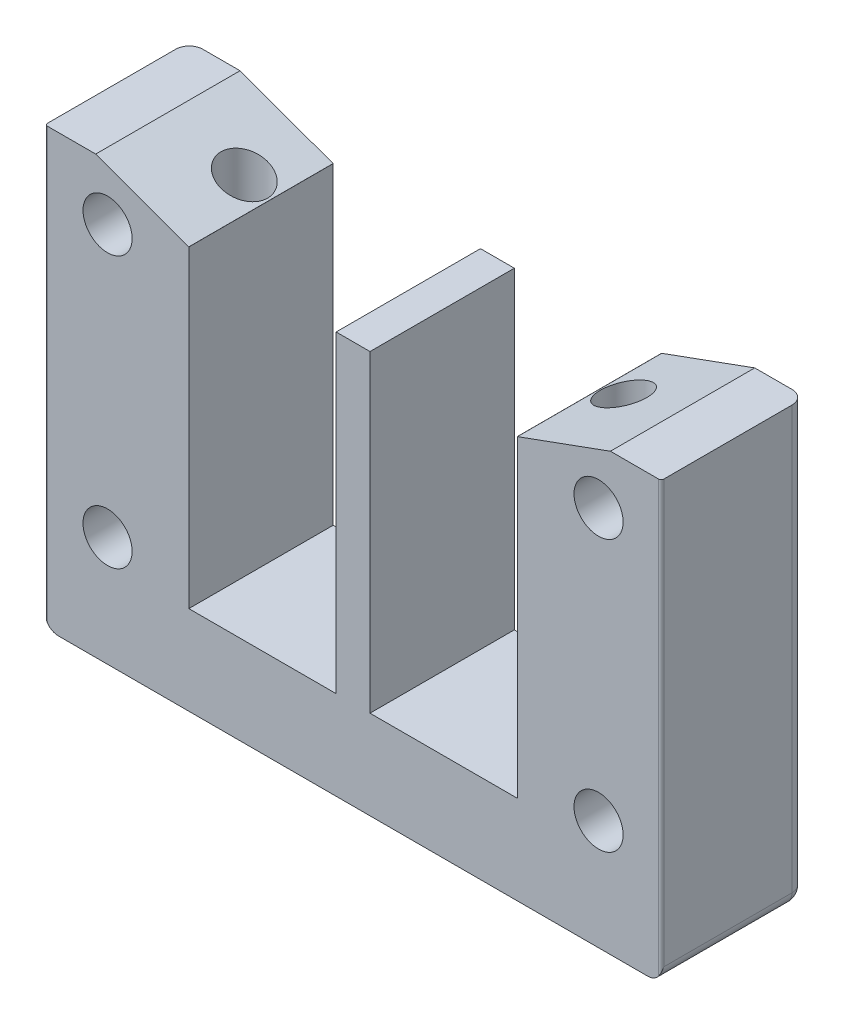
ISO-10303-21;
HEADER;
FILE_DESCRIPTION(('STEP AP214'),'2;1');
FILE_NAME('part.step','',(''),(''),'','','');
FILE_SCHEMA(('AUTOMOTIVE_DESIGN { 1 0 10303 214 1 1 1 1 }'));
ENDSEC;
DATA;
#1=APPLICATION_CONTEXT('core data for automotive mechanical design processes');
#2=APPLICATION_PROTOCOL_DEFINITION('international standard','automotive_design',2000,#1);
#3=PRODUCT_CONTEXT('',#1,'mechanical');
#4=PRODUCT('Part','Part','',(#3));
#5=PRODUCT_RELATED_PRODUCT_CATEGORY('part','',(#4));
#6=PRODUCT_DEFINITION_FORMATION('','',#4);
#7=PRODUCT_DEFINITION_CONTEXT('part definition',#1,'design');
#8=PRODUCT_DEFINITION('design','',#6,#7);
#9=PRODUCT_DEFINITION_SHAPE('','',#8);
#10=(LENGTH_UNIT() NAMED_UNIT(*) SI_UNIT(.MILLI.,.METRE.));
#11=(NAMED_UNIT(*) PLANE_ANGLE_UNIT() SI_UNIT($,.RADIAN.));
#12=(NAMED_UNIT(*) SI_UNIT($,.STERADIAN.) SOLID_ANGLE_UNIT());
#13=UNCERTAINTY_MEASURE_WITH_UNIT(LENGTH_MEASURE(1.E-05),#10,'distance_accuracy_value','');
#14=(GEOMETRIC_REPRESENTATION_CONTEXT(3) GLOBAL_UNCERTAINTY_ASSIGNED_CONTEXT((#13)) GLOBAL_UNIT_ASSIGNED_CONTEXT((#10,
#11,#12)) REPRESENTATION_CONTEXT('',''));
#15=CARTESIAN_POINT('',(0.,0.,0.));
#16=DIRECTION('',(0.,0.,1.));
#17=DIRECTION('',(1.,0.,0.));
#18=AXIS2_PLACEMENT_3D('',#15,#16,#17);
#19=CARTESIAN_POINT('',(-61.5719140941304,47.8391777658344,12.5060604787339));
#20=DIRECTION('',(0.,1.,0.));
#21=DIRECTION('',(1.,0.,0.));
#22=AXIS2_PLACEMENT_3D('',#19,#20,#21);
#23=PLANE('',#22);
#24=DIRECTION('',(0.,0.,-1.));
#25=VECTOR('',#24,1.);
#26=CARTESIAN_POINT('',(-61.5719140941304,47.8391777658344,12.5060604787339));
#27=LINE('',#26,#25);
#28=CARTESIAN_POINT('',(-61.5719140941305,47.8391777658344,12.2060604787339));
#29=VERTEX_POINT('',#28);
#30=CARTESIAN_POINT('',(-61.5719140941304,47.8391777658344,-2.94393952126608));
#31=VERTEX_POINT('',#30);
#32=EDGE_CURVE('E594',#29,#31,#27,.T.);
#33=ORIENTED_EDGE('',*,*,#32,.F.);
#34=CARTESIAN_POINT('',(-61.2719140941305,47.8391777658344,12.2060604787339));
#35=DIRECTION('',(0.,-1.,0.));
#36=DIRECTION('',(0.,0.,1.));
#37=AXIS2_PLACEMENT_3D('',#34,#35,#36);
#38=CIRCLE('',#37,0.3);
#39=CARTESIAN_POINT('',(-61.2719140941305,47.8391777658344,12.5060604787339));
#40=VERTEX_POINT('',#39);
#41=EDGE_CURVE('E556',#40,#29,#38,.T.);
#42=ORIENTED_EDGE('',*,*,#41,.F.);
#43=DIRECTION('',(1.,0.,0.));
#44=VECTOR('',#43,1.);
#45=CARTESIAN_POINT('',(-61.5719140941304,47.8391777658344,12.5060604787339));
#46=LINE('',#45,#44);
#47=CARTESIAN_POINT('',(-55.5719140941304,47.8391777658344,12.5060604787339));
#48=VERTEX_POINT('',#47);
#49=EDGE_CURVE('E220',#40,#48,#46,.T.);
#50=ORIENTED_EDGE('',*,*,#49,.T.);
#51=DIRECTION('',(0.,0.,-1.));
#52=VECTOR('',#51,1.);
#53=CARTESIAN_POINT('',(-55.5719140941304,47.8391777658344,12.5060604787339));
#54=LINE('',#53,#52);
#55=CARTESIAN_POINT('',(-55.5719140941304,47.8391777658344,-4.54393952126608));
#56=VERTEX_POINT('',#55);
#57=EDGE_CURVE('E25',#48,#56,#54,.T.);
#58=ORIENTED_EDGE('',*,*,#57,.T.);
#59=DIRECTION('',(1.,0.,0.));
#60=VECTOR('',#59,1.);
#61=CARTESIAN_POINT('',(-61.5719140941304,47.8391777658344,-4.54393952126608));
#62=LINE('',#61,#60);
#63=CARTESIAN_POINT('',(-59.9719140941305,47.8391777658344,-4.54393952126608));
#64=VERTEX_POINT('',#63);
#65=EDGE_CURVE('E255',#64,#56,#62,.T.);
#66=ORIENTED_EDGE('',*,*,#65,.F.);
#67=CARTESIAN_POINT('',(-59.9719140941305,47.8391777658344,-2.94393952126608));
#68=DIRECTION('',(0.,-1.,0.));
#69=DIRECTION('',(0.,0.,1.));
#70=AXIS2_PLACEMENT_3D('',#67,#68,#69);
#71=CIRCLE('',#70,1.6);
#72=EDGE_CURVE('E298',#31,#64,#71,.T.);
#73=ORIENTED_EDGE('',*,*,#72,.F.);
#74=EDGE_LOOP('',(#33,#42,#50,#58,#66,#73));
#75=FACE_BOUND('',#74,.T.);
#76=ADVANCED_FACE('F16',(#75),#23,.T.);
#77=CARTESIAN_POINT('',(-5.76182377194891,43.8391777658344,12.5060604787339));
#78=DIRECTION('',(0.,1.,0.));
#79=DIRECTION('',(1.,0.,0.));
#80=AXIS2_PLACEMENT_3D('',#77,#78,#79);
#81=PLANE('',#80);
#82=DIRECTION('',(0.,0.,-1.));
#83=VECTOR('',#82,1.);
#84=CARTESIAN_POINT('',(-44.5719140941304,43.8391777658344,12.5060604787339));
#85=LINE('',#84,#83);
#86=CARTESIAN_POINT('',(-44.5719140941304,43.8391777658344,12.5060604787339));
#87=VERTEX_POINT('',#86);
#88=CARTESIAN_POINT('',(-44.5719140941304,43.8391777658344,-4.54393952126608));
#89=VERTEX_POINT('',#88);
#90=EDGE_CURVE('E364',#87,#89,#85,.T.);
#91=ORIENTED_EDGE('',*,*,#90,.T.);
#92=DIRECTION('',(1.,0.,0.));
#93=VECTOR('',#92,1.);
#94=CARTESIAN_POINT('',(-5.76182377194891,43.8391777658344,-4.54393952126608));
#95=LINE('',#94,#93);
#96=CARTESIAN_POINT('',(-44.582004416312,43.8391777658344,-4.54393952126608));
#97=VERTEX_POINT('',#96);
#98=EDGE_CURVE('E210',#97,#89,#95,.T.);
#99=ORIENTED_EDGE('',*,*,#98,.F.);
#100=DIRECTION('',(0.,0.,-1.));
#101=VECTOR('',#100,1.);
#102=CARTESIAN_POINT('',(-44.582004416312,43.8391777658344,12.5060604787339));
#103=LINE('',#102,#101);
#104=CARTESIAN_POINT('',(-44.582004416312,43.8391777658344,12.5060604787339));
#105=VERTEX_POINT('',#104);
#106=EDGE_CURVE('E11',#105,#97,#103,.T.);
#107=ORIENTED_EDGE('',*,*,#106,.F.);
#108=DIRECTION('',(1.,0.,0.));
#109=VECTOR('',#108,1.);
#110=CARTESIAN_POINT('',(-5.76182377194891,43.8391777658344,12.5060604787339));
#111=LINE('',#110,#109);
#112=EDGE_CURVE('E208',#105,#87,#111,.T.);
#113=ORIENTED_EDGE('',*,*,#112,.T.);
#114=EDGE_LOOP('',(#91,#99,#107,#113));
#115=FACE_BOUND('',#114,.T.);
#116=ADVANCED_FACE('F206',(#115),#81,.T.);
#117=CARTESIAN_POINT('',(-55.5719140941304,47.8391777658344,12.5060604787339));
#118=DIRECTION('',(0.342020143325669,0.939692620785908,0.));
#119=DIRECTION('',(0.,0.,-1.));
#120=AXIS2_PLACEMENT_3D('',#117,#118,#119);
#121=PLANE('',#120);
#122=CARTESIAN_POINT('',(-50.3219140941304,45.9283340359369,2.95606047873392));
#123=CARTESIAN_POINT('',(-50.3219140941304,45.9283340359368,-2.54393952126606));
#124=CARTESIAN_POINT('',(-44.8219140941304,43.9264977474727,-2.54393952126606));
#125=CARTESIAN_POINT('',(-44.8219140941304,43.9264977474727,2.95606047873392));
#126=CARTESIAN_POINT('',(-44.8219140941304,43.9264977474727,8.45606047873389));
#127=CARTESIAN_POINT('',(-50.3219140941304,45.9283340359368,8.45606047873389));
#128=CARTESIAN_POINT('',(-50.3219140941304,45.9283340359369,2.95606047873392));
#129=(BOUNDED_CURVE() B_SPLINE_CURVE(3,(#122,#123,#124,#125,#126,#127,#128),.UNSPECIFIED.,.T.,
.F.) B_SPLINE_CURVE_WITH_KNOTS((4,3,4),(0.,3.1415926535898,6.28318530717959),
.UNSPECIFIED.) CURVE() GEOMETRIC_REPRESENTATION_ITEM() RATIONAL_B_SPLINE_CURVE((1.,
0.333333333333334,0.333333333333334,1.,0.333333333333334,0.333333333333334,1.)) REPRESENTATION_ITEM(''));
#130=CARTESIAN_POINT('',(-50.3219140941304,45.9283340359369,2.95606047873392));
#131=VERTEX_POINT('',#130);
#132=EDGE_CURVE('E428',#131,#131,#129,.T.);
#133=ORIENTED_EDGE('',*,*,#132,.T.);
#134=EDGE_LOOP('',(#133));
#135=FACE_BOUND('',#134,.T.);
#136=DIRECTION('',(0.939692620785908,-0.342020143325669,0.));
#137=VECTOR('',#136,1.);
#138=CARTESIAN_POINT('',(-55.5719140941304,47.8391777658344,-4.54393952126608));
#139=LINE('',#138,#137);
#140=EDGE_CURVE('E252',#56,#97,#139,.T.);
#141=ORIENTED_EDGE('',*,*,#140,.F.);
#142=ORIENTED_EDGE('',*,*,#57,.F.);
#143=DIRECTION('',(0.939692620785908,-0.342020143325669,0.));
#144=VECTOR('',#143,1.);
#145=CARTESIAN_POINT('',(-55.5719140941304,47.8391777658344,12.5060604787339));
#146=LINE('',#145,#144);
#147=EDGE_CURVE('E215',#48,#105,#146,.T.);
#148=ORIENTED_EDGE('',*,*,#147,.T.);
#149=ORIENTED_EDGE('',*,*,#106,.T.);
#150=EDGE_LOOP('',(#141,#142,#148,#149));
#151=FACE_BOUND('',#150,.T.);
#152=ADVANCED_FACE('F216',(#135,#151),#121,.T.);
#153=CARTESIAN_POINT('',(5.22808590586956,47.8391777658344,12.5060604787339));
#154=DIRECTION('',(-0.342020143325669,0.939692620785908,0.));
#155=DIRECTION('',(0.,0.,1.));
#156=AXIS2_PLACEMENT_3D('',#153,#154,#155);
#157=PLANE('',#156);
#158=CARTESIAN_POINT('',(-0.0219140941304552,45.9283340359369,2.95606047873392));
#159=CARTESIAN_POINT('',(-0.0219140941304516,45.9283340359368,8.45606047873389));
#160=CARTESIAN_POINT('',(-5.52191409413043,43.9264977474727,8.45606047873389));
#161=CARTESIAN_POINT('',(-5.52191409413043,43.9264977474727,2.95606047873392));
#162=CARTESIAN_POINT('',(-5.52191409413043,43.9264977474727,-2.54393952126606));
#163=CARTESIAN_POINT('',(-0.0219140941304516,45.9283340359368,-2.54393952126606));
#164=CARTESIAN_POINT('',(-0.0219140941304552,45.9283340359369,2.95606047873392));
#165=(BOUNDED_CURVE() B_SPLINE_CURVE(3,(#158,#159,#160,#161,#162,#163,#164),.UNSPECIFIED.,.T.,
.F.) B_SPLINE_CURVE_WITH_KNOTS((4,3,4),(0.,3.1415926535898,6.28318530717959),
.UNSPECIFIED.) CURVE() GEOMETRIC_REPRESENTATION_ITEM() RATIONAL_B_SPLINE_CURVE((1.,
0.333333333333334,0.333333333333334,1.,0.333333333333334,0.333333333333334,1.)) REPRESENTATION_ITEM(''));
#166=CARTESIAN_POINT('',(-0.0219140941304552,45.9283340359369,2.95606047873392));
#167=VERTEX_POINT('',#166);
#168=EDGE_CURVE('E312',#167,#167,#165,.T.);
#169=ORIENTED_EDGE('',*,*,#168,.T.);
#170=EDGE_LOOP('',(#169));
#171=FACE_BOUND('',#170,.T.);
#172=DIRECTION('',(0.939692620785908,0.342020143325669,0.));
#173=VECTOR('',#172,1.);
#174=CARTESIAN_POINT('',(5.22808590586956,47.8391777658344,-4.54393952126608));
#175=LINE('',#174,#173);
#176=CARTESIAN_POINT('',(-5.76182377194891,43.8391777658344,-4.54393952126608));
#177=VERTEX_POINT('',#176);
#178=CARTESIAN_POINT('',(5.22808590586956,47.8391777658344,-4.54393952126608));
#179=VERTEX_POINT('',#178);
#180=EDGE_CURVE('E374',#177,#179,#175,.T.);
#181=ORIENTED_EDGE('',*,*,#180,.F.);
#182=DIRECTION('',(0.,0.,-1.));
#183=VECTOR('',#182,1.);
#184=CARTESIAN_POINT('',(-5.76182377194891,43.8391777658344,12.5060604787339));
#185=LINE('',#184,#183);
#186=CARTESIAN_POINT('',(-5.76182377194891,43.8391777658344,12.5060604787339));
#187=VERTEX_POINT('',#186);
#188=EDGE_CURVE('E37',#187,#177,#185,.T.);
#189=ORIENTED_EDGE('',*,*,#188,.F.);
#190=DIRECTION('',(0.939692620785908,0.342020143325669,0.));
#191=VECTOR('',#190,1.);
#192=CARTESIAN_POINT('',(5.22808590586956,47.8391777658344,12.5060604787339));
#193=LINE('',#192,#191);
#194=CARTESIAN_POINT('',(5.22808590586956,47.8391777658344,12.5060604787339));
#195=VERTEX_POINT('',#194);
#196=EDGE_CURVE('E598',#187,#195,#193,.T.);
#197=ORIENTED_EDGE('',*,*,#196,.T.);
#198=DIRECTION('',(0.,0.,-1.));
#199=VECTOR('',#198,1.);
#200=CARTESIAN_POINT('',(5.22808590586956,47.8391777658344,12.5060604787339));
#201=LINE('',#200,#199);
#202=EDGE_CURVE('E50',#195,#179,#201,.T.);
#203=ORIENTED_EDGE('',*,*,#202,.T.);
#204=EDGE_LOOP('',(#181,#189,#197,#203));
#205=FACE_BOUND('',#204,.T.);
#206=ADVANCED_FACE('F643',(#171,#205),#157,.T.);
#207=CARTESIAN_POINT('',(11.2280859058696,47.8391777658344,12.5060604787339));
#208=DIRECTION('',(0.,1.,0.));
#209=DIRECTION('',(1.,0.,0.));
#210=AXIS2_PLACEMENT_3D('',#207,#208,#209);
#211=PLANE('',#210);
#212=DIRECTION('',(1.,0.,0.));
#213=VECTOR('',#212,1.);
#214=CARTESIAN_POINT('',(11.2280859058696,47.8391777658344,-4.54393952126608));
#215=LINE('',#214,#213);
#216=CARTESIAN_POINT('',(9.62808590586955,47.8391777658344,-4.54393952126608));
#217=VERTEX_POINT('',#216);
#218=EDGE_CURVE('E383',#179,#217,#215,.T.);
#219=ORIENTED_EDGE('',*,*,#218,.F.);
#220=ORIENTED_EDGE('',*,*,#202,.F.);
#221=DIRECTION('',(1.,0.,0.));
#222=VECTOR('',#221,1.);
#223=CARTESIAN_POINT('',(11.2280859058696,47.8391777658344,12.5060604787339));
#224=LINE('',#223,#222);
#225=CARTESIAN_POINT('',(10.9280859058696,47.8391777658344,12.5060604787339));
#226=VERTEX_POINT('',#225);
#227=EDGE_CURVE('E443',#195,#226,#224,.T.);
#228=ORIENTED_EDGE('',*,*,#227,.T.);
#229=CARTESIAN_POINT('',(10.9280859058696,47.8391777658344,12.2060604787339));
#230=DIRECTION('',(0.,-1.,0.));
#231=DIRECTION('',(0.,0.,1.));
#232=AXIS2_PLACEMENT_3D('',#229,#230,#231);
#233=CIRCLE('',#232,0.3);
#234=CARTESIAN_POINT('',(11.2280859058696,47.8391777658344,12.2060604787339));
#235=VERTEX_POINT('',#234);
#236=EDGE_CURVE('E280',#235,#226,#233,.T.);
#237=ORIENTED_EDGE('',*,*,#236,.F.);
#238=DIRECTION('',(0.,0.,-1.));
#239=VECTOR('',#238,1.);
#240=CARTESIAN_POINT('',(11.2280859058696,47.8391777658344,12.5060604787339));
#241=LINE('',#240,#239);
#242=CARTESIAN_POINT('',(11.2280859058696,47.8391777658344,-2.94393952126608));
#243=VERTEX_POINT('',#242);
#244=EDGE_CURVE('E234',#235,#243,#241,.T.);
#245=ORIENTED_EDGE('',*,*,#244,.T.);
#246=CARTESIAN_POINT('',(9.62808590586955,47.8391777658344,-2.94393952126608));
#247=DIRECTION('',(0.,-1.,0.));
#248=DIRECTION('',(0.,0.,1.));
#249=AXIS2_PLACEMENT_3D('',#246,#247,#248);
#250=CIRCLE('',#249,1.6);
#251=EDGE_CURVE('E404',#217,#243,#250,.T.);
#252=ORIENTED_EDGE('',*,*,#251,.F.);
#253=EDGE_LOOP('',(#219,#220,#228,#237,#245,#252));
#254=FACE_BOUND('',#253,.T.);
#255=ADVANCED_FACE('F639',(#254),#211,.T.);
#256=CARTESIAN_POINT('',(-5.76182377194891,43.8391777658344,12.5060604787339));
#257=DIRECTION('',(0.,1.,0.));
#258=DIRECTION('',(1.,0.,0.));
#259=AXIS2_PLACEMENT_3D('',#256,#257,#258);
#260=PLANE('',#259);
#261=DIRECTION('',(0.,0.,-1.));
#262=VECTOR('',#261,1.);
#263=CARTESIAN_POINT('',(-5.77191409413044,43.8391777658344,12.5060604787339));
#264=LINE('',#263,#262);
#265=CARTESIAN_POINT('',(-5.77191409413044,43.8391777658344,12.5060604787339));
#266=VERTEX_POINT('',#265);
#267=CARTESIAN_POINT('',(-5.77191409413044,43.8391777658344,-4.54393952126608));
#268=VERTEX_POINT('',#267);
#269=EDGE_CURVE('E532',#266,#268,#264,.T.);
#270=ORIENTED_EDGE('',*,*,#269,.F.);
#271=DIRECTION('',(1.,0.,0.));
#272=VECTOR('',#271,1.);
#273=CARTESIAN_POINT('',(-5.76182377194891,43.8391777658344,12.5060604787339));
#274=LINE('',#273,#272);
#275=EDGE_CURVE('E267',#266,#187,#274,.T.);
#276=ORIENTED_EDGE('',*,*,#275,.T.);
#277=ORIENTED_EDGE('',*,*,#188,.T.);
#278=DIRECTION('',(1.,0.,0.));
#279=VECTOR('',#278,1.);
#280=CARTESIAN_POINT('',(-5.76182377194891,43.8391777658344,-4.54393952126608));
#281=LINE('',#280,#279);
#282=EDGE_CURVE('E370',#268,#177,#281,.T.);
#283=ORIENTED_EDGE('',*,*,#282,.F.);
#284=EDGE_LOOP('',(#270,#276,#277,#283));
#285=FACE_BOUND('',#284,.T.);
#286=ADVANCED_FACE('F636',(#285),#260,.T.);
#287=CARTESIAN_POINT('',(-5.76182377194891,43.8391777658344,12.5060604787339));
#288=DIRECTION('',(0.,1.,0.));
#289=DIRECTION('',(1.,0.,0.));
#290=AXIS2_PLACEMENT_3D('',#287,#288,#289);
#291=PLANE('',#290);
#292=DIRECTION('',(1.,0.,0.));
#293=VECTOR('',#292,1.);
#294=CARTESIAN_POINT('',(-5.76182377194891,43.8391777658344,12.5060604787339));
#295=LINE('',#294,#293);
#296=CARTESIAN_POINT('',(-27.1719140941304,43.8391777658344,12.5060604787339));
#297=VERTEX_POINT('',#296);
#298=CARTESIAN_POINT('',(-23.1719140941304,43.8391777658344,12.5060604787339));
#299=VERTEX_POINT('',#298);
#300=EDGE_CURVE('E228',#297,#299,#295,.T.);
#301=ORIENTED_EDGE('',*,*,#300,.T.);
#302=DIRECTION('',(0.,0.,-1.));
#303=VECTOR('',#302,1.);
#304=CARTESIAN_POINT('',(-23.1719140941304,43.8391777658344,49.7216486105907));
#305=LINE('',#304,#303);
#306=CARTESIAN_POINT('',(-23.1719140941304,43.8391777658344,-4.54393952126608));
#307=VERTEX_POINT('',#306);
#308=EDGE_CURVE('E536',#299,#307,#305,.T.);
#309=ORIENTED_EDGE('',*,*,#308,.T.);
#310=DIRECTION('',(1.,0.,0.));
#311=VECTOR('',#310,1.);
#312=CARTESIAN_POINT('',(-5.76182377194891,43.8391777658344,-4.54393952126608));
#313=LINE('',#312,#311);
#314=CARTESIAN_POINT('',(-27.1719140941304,43.8391777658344,-4.54393952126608));
#315=VERTEX_POINT('',#314);
#316=EDGE_CURVE('E375',#315,#307,#313,.T.);
#317=ORIENTED_EDGE('',*,*,#316,.F.);
#318=DIRECTION('',(0.,0.,-1.));
#319=VECTOR('',#318,1.);
#320=CARTESIAN_POINT('',(-27.1719140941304,43.8391777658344,49.7216486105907));
#321=LINE('',#320,#319);
#322=EDGE_CURVE('E564',#297,#315,#321,.T.);
#323=ORIENTED_EDGE('',*,*,#322,.F.);
#324=EDGE_LOOP('',(#301,#309,#317,#323));
#325=FACE_BOUND('',#324,.T.);
#326=ADVANCED_FACE('F634',(#325),#291,.T.);
#327=CARTESIAN_POINT('',(-25.1719140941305,25.3391777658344,12.5060604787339));
#328=DIRECTION('',(0.,0.,1.));
#329=DIRECTION('',(1.,0.,0.));
#330=AXIS2_PLACEMENT_3D('',#327,#328,#329);
#331=PLANE('',#330);
#332=CARTESIAN_POINT('',(-54.1719140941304,9.33917776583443,12.5060604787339));
#333=DIRECTION('',(0.,0.,-1.));
#334=DIRECTION('',(-1.,0.,0.));
#335=AXIS2_PLACEMENT_3D('',#332,#333,#334);
#336=CIRCLE('',#335,2.9);
#337=CARTESIAN_POINT('',(-57.0719140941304,9.33917776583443,12.5060604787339));
#338=VERTEX_POINT('',#337);
#339=EDGE_CURVE('E484',#338,#338,#336,.T.);
#340=ORIENTED_EDGE('',*,*,#339,.T.);
#341=EDGE_LOOP('',(#340));
#342=FACE_BOUND('',#341,.T.);
#343=CARTESIAN_POINT('',(-54.1719140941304,41.3391777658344,12.5060604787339));
#344=DIRECTION('',(0.,0.,-1.));
#345=DIRECTION('',(-1.,0.,0.));
#346=AXIS2_PLACEMENT_3D('',#343,#344,#345);
#347=CIRCLE('',#346,2.9);
#348=CARTESIAN_POINT('',(-57.0719140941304,41.3391777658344,12.5060604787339));
#349=VERTEX_POINT('',#348);
#350=EDGE_CURVE('E492',#349,#349,#347,.T.);
#351=ORIENTED_EDGE('',*,*,#350,.T.);
#352=EDGE_LOOP('',(#351));
#353=FACE_BOUND('',#352,.T.);
#354=CARTESIAN_POINT('',(3.82808590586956,9.33917776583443,12.5060604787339));
#355=DIRECTION('',(0.,0.,-1.));
#356=DIRECTION('',(-1.,0.,0.));
#357=AXIS2_PLACEMENT_3D('',#354,#355,#356);
#358=CIRCLE('',#357,2.9);
#359=CARTESIAN_POINT('',(0.928085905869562,9.33917776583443,12.5060604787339));
#360=VERTEX_POINT('',#359);
#361=EDGE_CURVE('E496',#360,#360,#358,.T.);
#362=ORIENTED_EDGE('',*,*,#361,.T.);
#363=EDGE_LOOP('',(#362));
#364=FACE_BOUND('',#363,.T.);
#365=CARTESIAN_POINT('',(3.82808590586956,41.3391777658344,12.5060604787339));
#366=DIRECTION('',(0.,0.,-1.));
#367=DIRECTION('',(-1.,0.,0.));
#368=AXIS2_PLACEMENT_3D('',#365,#366,#367);
#369=CIRCLE('',#368,2.9);
#370=CARTESIAN_POINT('',(0.928085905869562,41.3391777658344,12.5060604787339));
#371=VERTEX_POINT('',#370);
#372=EDGE_CURVE('E505',#371,#371,#369,.T.);
#373=ORIENTED_EDGE('',*,*,#372,.T.);
#374=EDGE_LOOP('',(#373));
#375=FACE_BOUND('',#374,.T.);
#376=DIRECTION('',(0.,-1.,0.));
#377=VECTOR('',#376,1.);
#378=CARTESIAN_POINT('',(-23.1719140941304,6.83917776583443,12.5060604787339));
#379=LINE('',#378,#377);
#380=CARTESIAN_POINT('',(-23.1719140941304,6.83917776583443,12.5060604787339));
#381=VERTEX_POINT('',#380);
#382=EDGE_CURVE('E585',#299,#381,#379,.T.);
#383=ORIENTED_EDGE('',*,*,#382,.F.);
#384=ORIENTED_EDGE('',*,*,#300,.F.);
#385=DIRECTION('',(0.,1.,0.));
#386=VECTOR('',#385,1.);
#387=CARTESIAN_POINT('',(-27.1719140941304,6.83917776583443,12.5060604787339));
#388=LINE('',#387,#386);
#389=CARTESIAN_POINT('',(-27.1719140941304,6.83917776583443,12.5060604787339));
#390=VERTEX_POINT('',#389);
#391=EDGE_CURVE('E561',#390,#297,#388,.T.);
#392=ORIENTED_EDGE('',*,*,#391,.F.);
#393=DIRECTION('',(-1.,0.,0.));
#394=VECTOR('',#393,1.);
#395=CARTESIAN_POINT('',(-5.77191409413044,6.83917776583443,12.5060604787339));
#396=LINE('',#395,#394);
#397=CARTESIAN_POINT('',(-44.5719140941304,6.83917776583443,12.5060604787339));
#398=VERTEX_POINT('',#397);
#399=EDGE_CURVE('E537',#390,#398,#396,.T.);
#400=ORIENTED_EDGE('',*,*,#399,.T.);
#401=DIRECTION('',(0.,1.,0.));
#402=VECTOR('',#401,1.);
#403=CARTESIAN_POINT('',(-44.5719140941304,43.8391777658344,12.5060604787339));
#404=LINE('',#403,#402);
#405=EDGE_CURVE('E225',#398,#87,#404,.T.);
#406=ORIENTED_EDGE('',*,*,#405,.T.);
#407=ORIENTED_EDGE('',*,*,#112,.F.);
#408=ORIENTED_EDGE('',*,*,#147,.F.);
#409=ORIENTED_EDGE('',*,*,#49,.F.);
#410=DIRECTION('',(0.,-1.,0.));
#411=VECTOR('',#410,1.);
#412=CARTESIAN_POINT('',(-61.2719140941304,-3.66082223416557,12.5060604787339));
#413=LINE('',#412,#411);
#414=CARTESIAN_POINT('',(-61.2719140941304,-2.99356013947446,12.5060604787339));
#415=VERTEX_POINT('',#414);
#416=EDGE_CURVE('E489',#40,#415,#413,.T.);
#417=ORIENTED_EDGE('',*,*,#416,.T.);
#418=CARTESIAN_POINT('',(-59.9719140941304,-2.06082223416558,12.5060604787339));
#419=DIRECTION('',(0.,0.,1.));
#420=DIRECTION('',(1.,0.,0.));
#421=AXIS2_PLACEMENT_3D('',#418,#419,#420);
#422=CIRCLE('',#421,1.6);
#423=CARTESIAN_POINT('',(-59.9719140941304,-3.66082223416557,12.5060604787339));
#424=VERTEX_POINT('',#423);
#425=EDGE_CURVE('E687',#415,#424,#422,.T.);
#426=ORIENTED_EDGE('',*,*,#425,.T.);
#427=DIRECTION('',(1.,0.,0.));
#428=VECTOR('',#427,1.);
#429=CARTESIAN_POINT('',(-61.5719140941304,-3.66082223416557,12.5060604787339));
#430=LINE('',#429,#428);
#431=CARTESIAN_POINT('',(9.62808590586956,-3.66082223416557,12.5060604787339));
#432=VERTEX_POINT('',#431);
#433=EDGE_CURVE('E355',#424,#432,#430,.T.);
#434=ORIENTED_EDGE('',*,*,#433,.T.);
#435=CARTESIAN_POINT('',(9.62808590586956,-2.06082223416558,12.5060604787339));
#436=DIRECTION('',(0.,0.,1.));
#437=DIRECTION('',(1.,0.,0.));
#438=AXIS2_PLACEMENT_3D('',#435,#436,#437);
#439=CIRCLE('',#438,1.6);
#440=CARTESIAN_POINT('',(10.9280859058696,-2.99356013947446,12.5060604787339));
#441=VERTEX_POINT('',#440);
#442=EDGE_CURVE('E541',#432,#441,#439,.T.);
#443=ORIENTED_EDGE('',*,*,#442,.T.);
#444=DIRECTION('',(0.,1.,0.));
#445=VECTOR('',#444,1.);
#446=CARTESIAN_POINT('',(10.9280859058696,52.7391777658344,12.5060604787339));
#447=LINE('',#446,#445);
#448=EDGE_CURVE('E284',#441,#226,#447,.T.);
#449=ORIENTED_EDGE('',*,*,#448,.T.);
#450=ORIENTED_EDGE('',*,*,#227,.F.);
#451=ORIENTED_EDGE('',*,*,#196,.F.);
#452=ORIENTED_EDGE('',*,*,#275,.F.);
#453=DIRECTION('',(0.,-1.,0.));
#454=VECTOR('',#453,1.);
#455=CARTESIAN_POINT('',(-5.77191409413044,43.8391777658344,12.5060604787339));
#456=LINE('',#455,#454);
#457=CARTESIAN_POINT('',(-5.77191409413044,6.83917776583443,12.5060604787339));
#458=VERTEX_POINT('',#457);
#459=EDGE_CURVE('E500',#266,#458,#456,.T.);
#460=ORIENTED_EDGE('',*,*,#459,.T.);
#461=DIRECTION('',(-1.,0.,0.));
#462=VECTOR('',#461,1.);
#463=CARTESIAN_POINT('',(-5.77191409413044,6.83917776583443,12.5060604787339));
#464=LINE('',#463,#462);
#465=EDGE_CURVE('E479',#458,#381,#464,.T.);
#466=ORIENTED_EDGE('',*,*,#465,.T.);
#467=EDGE_LOOP('',(#383,#384,#392,#400,#406,#407,#408,#409,#417,#426,#434,#443,#449,#450,#451,
#452,#460,#466));
#468=FACE_BOUND('',#467,.T.);
#469=ADVANCED_FACE('F223',(#342,#353,#364,#375,#468),#331,.T.);
#470=CARTESIAN_POINT('',(11.2280859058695,54.3391777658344,12.5060604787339));
#471=DIRECTION('',(-1.,0.,0.));
#472=DIRECTION('',(0.,1.,0.));
#473=AXIS2_PLACEMENT_3D('',#470,#471,#472);
#474=PLANE('',#473);
#475=ORIENTED_EDGE('',*,*,#244,.F.);
#476=DIRECTION('',(0.,-1.,0.));
#477=VECTOR('',#476,1.);
#478=CARTESIAN_POINT('',(11.2280859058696,-3.66082223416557,12.2060604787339));
#479=LINE('',#478,#477);
#480=CARTESIAN_POINT('',(11.2280859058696,-2.06082223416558,12.2060604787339));
#481=VERTEX_POINT('',#480);
#482=EDGE_CURVE('E285',#235,#481,#479,.T.);
#483=ORIENTED_EDGE('',*,*,#482,.T.);
#484=DIRECTION('',(0.,0.,-1.));
#485=VECTOR('',#484,1.);
#486=CARTESIAN_POINT('',(11.2280859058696,-2.06082223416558,12.5060604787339));
#487=LINE('',#486,#485);
#488=CARTESIAN_POINT('',(11.2280859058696,-2.06082223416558,-2.94393952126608));
#489=VERTEX_POINT('',#488);
#490=EDGE_CURVE('E689',#481,#489,#487,.T.);
#491=ORIENTED_EDGE('',*,*,#490,.T.);
#492=DIRECTION('',(0.,1.,0.));
#493=VECTOR('',#492,1.);
#494=CARTESIAN_POINT('',(11.2280859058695,54.3391777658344,-2.94393952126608));
#495=LINE('',#494,#493);
#496=EDGE_CURVE('E501',#489,#243,#495,.T.);
#497=ORIENTED_EDGE('',*,*,#496,.T.);
#498=EDGE_LOOP('',(#475,#483,#491,#497));
#499=FACE_BOUND('',#498,.T.);
#500=ADVANCED_FACE('F626',(#499),#474,.F.);
#501=CARTESIAN_POINT('',(10.9280859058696,25.3391777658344,12.2060604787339));
#502=DIRECTION('',(0.,-1.,0.));
#503=DIRECTION('',(1.,0.,0.));
#504=AXIS2_PLACEMENT_3D('',#501,#502,#503);
#505=CYLINDRICAL_SURFACE('',#504,0.3);
#506=ORIENTED_EDGE('',*,*,#482,.F.);
#507=ORIENTED_EDGE('',*,*,#236,.T.);
#508=ORIENTED_EDGE('',*,*,#448,.F.);
#509=CARTESIAN_POINT('',(10.9280859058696,-2.99356013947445,12.5060604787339));
#510=CARTESIAN_POINT('',(10.9331419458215,-2.98651306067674,12.506060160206));
#511=CARTESIAN_POINT('',(10.9381365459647,-2.97942260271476,12.5059326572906));
#512=CARTESIAN_POINT('',(10.948166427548,-2.96492525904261,12.5054312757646));
#513=CARTESIAN_POINT('',(10.9531974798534,-2.95751572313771,12.5050492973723));
#514=CARTESIAN_POINT('',(10.9632870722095,-2.94238035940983,12.5040326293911));
#515=CARTESIAN_POINT('',(10.9683411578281,-2.93465209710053,12.5033901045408));
#516=CARTESIAN_POINT('',(10.9784629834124,-2.91887900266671,12.5018461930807));
#517=CARTESIAN_POINT('',(10.9835260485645,-2.91083191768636,12.5009372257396));
#518=CARTESIAN_POINT('',(10.9936513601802,-2.89442095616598,12.4988551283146));
#519=CARTESIAN_POINT('',(10.9987087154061,-2.88605499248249,12.4976746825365));
#520=CARTESIAN_POINT('',(11.0088072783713,-2.86900638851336,12.4950450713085));
#521=CARTESIAN_POINT('',(11.0138433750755,-2.86032182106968,12.4935888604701));
#522=CARTESIAN_POINT('',(11.0291232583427,-2.83340640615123,12.4887422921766));
#523=CARTESIAN_POINT('',(11.0390692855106,-2.81507321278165,12.4849718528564));
#524=CARTESIAN_POINT('',(11.0587226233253,-2.77714584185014,12.4763485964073));
#525=CARTESIAN_POINT('',(11.0683840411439,-2.75753933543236,12.471446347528));
#526=CARTESIAN_POINT('',(11.0873306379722,-2.71706220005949,12.4605538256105));
#527=CARTESIAN_POINT('',(11.0965668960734,-2.69618074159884,12.4545189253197));
#528=CARTESIAN_POINT('',(11.1145160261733,-2.65315154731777,12.4413772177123));
#529=CARTESIAN_POINT('',(11.1231769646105,-2.63099427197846,12.4342310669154));
#530=CARTESIAN_POINT('',(11.1398352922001,-2.58541678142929,12.4188900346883));
#531=CARTESIAN_POINT('',(11.1477785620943,-2.56198837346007,12.4106607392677));
#532=CARTESIAN_POINT('',(11.159341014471,-2.52498009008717,12.3972744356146));
#533=CARTESIAN_POINT('',(11.1633607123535,-2.51145657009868,12.392302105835));
#534=CARTESIAN_POINT('',(11.1715194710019,-2.48259092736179,12.3815355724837));
#535=CARTESIAN_POINT('',(11.1756054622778,-2.46724213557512,12.3757188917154));
#536=CARTESIAN_POINT('',(11.1837589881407,-2.43472814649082,12.3632014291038));
#537=CARTESIAN_POINT('',(11.1877697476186,-2.41755815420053,12.3564761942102));
#538=CARTESIAN_POINT('',(11.1956070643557,-2.38139941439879,12.3420981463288));
#539=CARTESIAN_POINT('',(11.1993714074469,-2.36240667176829,12.3344214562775));
#540=CARTESIAN_POINT('',(11.2065292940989,-2.32260201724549,12.31811327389));
#541=CARTESIAN_POINT('',(11.2098547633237,-2.30178685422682,12.3094598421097));
#542=CARTESIAN_POINT('',(11.2159262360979,-2.2583366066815,12.2911975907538));
#543=CARTESIAN_POINT('',(11.2185979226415,-2.23569878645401,12.2815705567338));
#544=CARTESIAN_POINT('',(11.2231338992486,-2.18860290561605,12.2613941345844));
#545=CARTESIAN_POINT('',(11.224917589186,-2.16414253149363,12.2508320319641));
#546=CARTESIAN_POINT('',(11.2274376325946,-2.11340071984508,12.2288610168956));
#547=CARTESIAN_POINT('',(11.2280876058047,-2.08711725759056,12.2174467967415));
#548=CARTESIAN_POINT('',(11.2280859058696,-2.06082223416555,12.2060604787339));
#549=B_SPLINE_CURVE_WITH_KNOTS('',3,(#509,#510,#511,#512,#513,#514,#515,#516,#517,#518,#519,
#520,#521,#522,#523,#524,#525,#526,#527,#528,#529,#530,#531,#532,#533,#534,#535,#536,#537,#538,
#539,#540,#541,#542,#543,#544,#545,#546,#547,#548),.UNSPECIFIED.,.F.,.F.,(4,2,2,2,2,2,2,2,2,2,2,
2,2,2,2,2,2,2,2,4),(0.,0.0260176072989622,0.0529056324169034,0.0806705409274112,
0.109318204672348,0.138853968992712,0.169282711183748,0.23282996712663,0.299998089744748,
0.370813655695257,0.445299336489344,0.523474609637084,0.568346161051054,0.619082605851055,
0.675686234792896,0.738158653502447,0.806501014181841,0.880714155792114,0.96079869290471,
1.04675507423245),.UNSPECIFIED.);
#550=EDGE_CURVE('E608',#441,#481,#549,.T.);
#551=ORIENTED_EDGE('',*,*,#550,.T.);
#552=EDGE_LOOP('',(#506,#507,#508,#551));
#553=FACE_BOUND('',#552,.T.);
#554=ADVANCED_FACE('F615',(#553),#505,.T.);
#555=CARTESIAN_POINT('',(-61.5719140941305,54.3391777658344,12.5060604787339));
#556=DIRECTION('',(1.,0.,0.));
#557=DIRECTION('',(0.,1.,0.));
#558=AXIS2_PLACEMENT_3D('',#555,#556,#557);
#559=PLANE('',#558);
#560=ORIENTED_EDGE('',*,*,#32,.T.);
#561=DIRECTION('',(0.,-1.,0.));
#562=VECTOR('',#561,1.);
#563=CARTESIAN_POINT('',(-61.5719140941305,54.3391777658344,-2.94393952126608));
#564=LINE('',#563,#562);
#565=CARTESIAN_POINT('',(-61.5719140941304,-2.06082223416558,-2.94393952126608));
#566=VERTEX_POINT('',#565);
#567=EDGE_CURVE('E529',#31,#566,#564,.T.);
#568=ORIENTED_EDGE('',*,*,#567,.T.);
#569=DIRECTION('',(0.,0.,1.));
#570=VECTOR('',#569,1.);
#571=CARTESIAN_POINT('',(-61.5719140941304,-2.06082223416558,12.5060604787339));
#572=LINE('',#571,#570);
#573=CARTESIAN_POINT('',(-61.5719140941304,-2.06082223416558,12.2060604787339));
#574=VERTEX_POINT('',#573);
#575=EDGE_CURVE('E668',#566,#574,#572,.T.);
#576=ORIENTED_EDGE('',*,*,#575,.T.);
#577=DIRECTION('',(0.,1.,0.));
#578=VECTOR('',#577,1.);
#579=CARTESIAN_POINT('',(-61.5719140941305,52.7391777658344,12.2060604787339));
#580=LINE('',#579,#578);
#581=EDGE_CURVE('E560',#574,#29,#580,.T.);
#582=ORIENTED_EDGE('',*,*,#581,.T.);
#583=EDGE_LOOP('',(#560,#568,#576,#582));
#584=FACE_BOUND('',#583,.T.);
#585=ADVANCED_FACE('F625',(#584),#559,.F.);
#586=CARTESIAN_POINT('',(-25.1719140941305,25.3391777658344,-4.54393952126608));
#587=DIRECTION('',(0.,0.,1.));
#588=DIRECTION('',(1.,0.,0.));
#589=AXIS2_PLACEMENT_3D('',#586,#587,#588);
#590=PLANE('',#589);
#591=CARTESIAN_POINT('',(3.82808590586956,41.3391777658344,-4.54393952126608));
#592=DIRECTION('',(0.,0.,-1.));
#593=DIRECTION('',(-1.,0.,0.));
#594=AXIS2_PLACEMENT_3D('',#591,#592,#593);
#595=CIRCLE('',#594,5.);
#596=CARTESIAN_POINT('',(-1.17191409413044,41.3391777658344,-4.54393952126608));
#597=VERTEX_POINT('',#596);
#598=EDGE_CURVE('E515',#597,#597,#595,.T.);
#599=ORIENTED_EDGE('',*,*,#598,.F.);
#600=EDGE_LOOP('',(#599));
#601=FACE_BOUND('',#600,.T.);
#602=CARTESIAN_POINT('',(3.82808590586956,9.33917776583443,-4.54393952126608));
#603=DIRECTION('',(0.,0.,-1.));
#604=DIRECTION('',(-1.,0.,0.));
#605=AXIS2_PLACEMENT_3D('',#602,#603,#604);
#606=CIRCLE('',#605,5.);
#607=CARTESIAN_POINT('',(-1.17191409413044,9.33917776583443,-4.54393952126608));
#608=VERTEX_POINT('',#607);
#609=EDGE_CURVE('E518',#608,#608,#606,.T.);
#610=ORIENTED_EDGE('',*,*,#609,.F.);
#611=EDGE_LOOP('',(#610));
#612=FACE_BOUND('',#611,.T.);
#613=CARTESIAN_POINT('',(-54.1719140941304,9.33917776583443,-4.54393952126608));
#614=DIRECTION('',(0.,0.,-1.));
#615=DIRECTION('',(-1.,0.,0.));
#616=AXIS2_PLACEMENT_3D('',#613,#614,#615);
#617=CIRCLE('',#616,5.);
#618=CARTESIAN_POINT('',(-59.1719140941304,9.33917776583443,-4.54393952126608));
#619=VERTEX_POINT('',#618);
#620=EDGE_CURVE('E524',#619,#619,#617,.T.);
#621=ORIENTED_EDGE('',*,*,#620,.F.);
#622=EDGE_LOOP('',(#621));
#623=FACE_BOUND('',#622,.T.);
#624=CARTESIAN_POINT('',(-54.1719140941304,41.3391777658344,-4.54393952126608));
#625=DIRECTION('',(0.,0.,-1.));
#626=DIRECTION('',(-1.,0.,0.));
#627=AXIS2_PLACEMENT_3D('',#624,#625,#626);
#628=CIRCLE('',#627,5.);
#629=CARTESIAN_POINT('',(-59.1719140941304,41.3391777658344,-4.54393952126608));
#630=VERTEX_POINT('',#629);
#631=EDGE_CURVE('E302',#630,#630,#628,.T.);
#632=ORIENTED_EDGE('',*,*,#631,.F.);
#633=EDGE_LOOP('',(#632));
#634=FACE_BOUND('',#633,.T.);
#635=ORIENTED_EDGE('',*,*,#316,.T.);
#636=DIRECTION('',(0.,-1.,0.));
#637=VECTOR('',#636,1.);
#638=CARTESIAN_POINT('',(-23.1719140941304,6.83917776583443,-4.54393952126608));
#639=LINE('',#638,#637);
#640=CARTESIAN_POINT('',(-23.1719140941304,6.83917776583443,-4.54393952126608));
#641=VERTEX_POINT('',#640);
#642=EDGE_CURVE('E463',#307,#641,#639,.T.);
#643=ORIENTED_EDGE('',*,*,#642,.T.);
#644=DIRECTION('',(-1.,0.,0.));
#645=VECTOR('',#644,1.);
#646=CARTESIAN_POINT('',(-5.77191409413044,6.83917776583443,-4.54393952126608));
#647=LINE('',#646,#645);
#648=CARTESIAN_POINT('',(-5.77191409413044,6.83917776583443,-4.54393952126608));
#649=VERTEX_POINT('',#648);
#650=EDGE_CURVE('E480',#649,#641,#647,.T.);
#651=ORIENTED_EDGE('',*,*,#650,.F.);
#652=DIRECTION('',(0.,-1.,0.));
#653=VECTOR('',#652,1.);
#654=CARTESIAN_POINT('',(-5.77191409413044,43.8391777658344,-4.54393952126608));
#655=LINE('',#654,#653);
#656=EDGE_CURVE('E497',#268,#649,#655,.T.);
#657=ORIENTED_EDGE('',*,*,#656,.F.);
#658=ORIENTED_EDGE('',*,*,#282,.T.);
#659=ORIENTED_EDGE('',*,*,#180,.T.);
#660=ORIENTED_EDGE('',*,*,#218,.T.);
#661=DIRECTION('',(0.,-1.,0.));
#662=VECTOR('',#661,1.);
#663=CARTESIAN_POINT('',(9.62808590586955,25.3391777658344,-4.54393952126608));
#664=LINE('',#663,#662);
#665=CARTESIAN_POINT('',(9.62808590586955,-2.06082223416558,-4.54393952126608));
#666=VERTEX_POINT('',#665);
#667=EDGE_CURVE('E297',#217,#666,#664,.T.);
#668=ORIENTED_EDGE('',*,*,#667,.T.);
#669=DIRECTION('',(-1.,0.,0.));
#670=VECTOR('',#669,1.);
#671=CARTESIAN_POINT('',(-25.1719140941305,-2.06082223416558,-4.54393952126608));
#672=LINE('',#671,#670);
#673=CARTESIAN_POINT('',(-59.9719140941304,-2.06082223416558,-4.54393952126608));
#674=VERTEX_POINT('',#673);
#675=EDGE_CURVE('E325',#666,#674,#672,.T.);
#676=ORIENTED_EDGE('',*,*,#675,.T.);
#677=DIRECTION('',(0.,1.,0.));
#678=VECTOR('',#677,1.);
#679=CARTESIAN_POINT('',(-59.9719140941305,25.3391777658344,-4.54393952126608));
#680=LINE('',#679,#678);
#681=EDGE_CURVE('E293',#674,#64,#680,.T.);
#682=ORIENTED_EDGE('',*,*,#681,.T.);
#683=ORIENTED_EDGE('',*,*,#65,.T.);
#684=ORIENTED_EDGE('',*,*,#140,.T.);
#685=ORIENTED_EDGE('',*,*,#98,.T.);
#686=DIRECTION('',(0.,1.,0.));
#687=VECTOR('',#686,1.);
#688=CARTESIAN_POINT('',(-44.5719140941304,43.8391777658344,-4.54393952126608));
#689=LINE('',#688,#687);
#690=CARTESIAN_POINT('',(-44.5719140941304,6.83917776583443,-4.54393952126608));
#691=VERTEX_POINT('',#690);
#692=EDGE_CURVE('E360',#691,#89,#689,.T.);
#693=ORIENTED_EDGE('',*,*,#692,.F.);
#694=DIRECTION('',(-1.,0.,0.));
#695=VECTOR('',#694,1.);
#696=CARTESIAN_POINT('',(-5.77191409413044,6.83917776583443,-4.54393952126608));
#697=LINE('',#696,#695);
#698=CARTESIAN_POINT('',(-27.1719140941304,6.83917776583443,-4.54393952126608));
#699=VERTEX_POINT('',#698);
#700=EDGE_CURVE('E545',#699,#691,#697,.T.);
#701=ORIENTED_EDGE('',*,*,#700,.F.);
#702=DIRECTION('',(0.,1.,0.));
#703=VECTOR('',#702,1.);
#704=CARTESIAN_POINT('',(-27.1719140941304,6.83917776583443,-4.54393952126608));
#705=LINE('',#704,#703);
#706=EDGE_CURVE('E365',#699,#315,#705,.T.);
#707=ORIENTED_EDGE('',*,*,#706,.T.);
#708=EDGE_LOOP('',(#635,#643,#651,#657,#658,#659,#660,#668,#676,#682,#683,#684,#685,#693,#701,#707));
#709=FACE_BOUND('',#708,.T.);
#710=ADVANCED_FACE('F627',(#601,#612,#623,#634,#709),#590,.F.);
#711=CARTESIAN_POINT('',(-23.1719140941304,6.83917776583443,49.7216486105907));
#712=DIRECTION('',(1.,0.,0.));
#713=DIRECTION('',(0.,1.,0.));
#714=AXIS2_PLACEMENT_3D('',#711,#712,#713);
#715=PLANE('',#714);
#716=ORIENTED_EDGE('',*,*,#308,.F.);
#717=ORIENTED_EDGE('',*,*,#382,.T.);
#718=DIRECTION('',(0.,0.,-1.));
#719=VECTOR('',#718,1.);
#720=CARTESIAN_POINT('',(-23.1719140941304,6.83917776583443,49.7216486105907));
#721=LINE('',#720,#719);
#722=EDGE_CURVE('E475',#381,#641,#721,.T.);
#723=ORIENTED_EDGE('',*,*,#722,.T.);
#724=ORIENTED_EDGE('',*,*,#642,.F.);
#725=EDGE_LOOP('',(#716,#717,#723,#724));
#726=FACE_BOUND('',#725,.T.);
#727=ADVANCED_FACE('F1121',(#726),#715,.T.);
#728=CARTESIAN_POINT('',(-5.77191409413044,43.8391777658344,12.5060604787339));
#729=DIRECTION('',(1.,0.,0.));
#730=DIRECTION('',(0.,1.,0.));
#731=AXIS2_PLACEMENT_3D('',#728,#729,#730);
#732=PLANE('',#731);
#733=ORIENTED_EDGE('',*,*,#656,.T.);
#734=DIRECTION('',(0.,0.,-1.));
#735=VECTOR('',#734,1.);
#736=CARTESIAN_POINT('',(-5.77191409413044,6.83917776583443,12.5060604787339));
#737=LINE('',#736,#735);
#738=EDGE_CURVE('E485',#458,#649,#737,.T.);
#739=ORIENTED_EDGE('',*,*,#738,.F.);
#740=ORIENTED_EDGE('',*,*,#459,.F.);
#741=ORIENTED_EDGE('',*,*,#269,.T.);
#742=EDGE_LOOP('',(#733,#739,#740,#741));
#743=FACE_BOUND('',#742,.T.);
#744=ADVANCED_FACE('F923',(#743),#732,.F.);
#745=CARTESIAN_POINT('',(9.62808590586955,54.3391777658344,-2.94393952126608));
#746=DIRECTION('',(0.,1.,0.));
#747=DIRECTION('',(-1.,0.,0.));
#748=AXIS2_PLACEMENT_3D('',#745,#746,#747);
#749=CYLINDRICAL_SURFACE('',#748,1.6);
#750=ORIENTED_EDGE('',*,*,#667,.F.);
#751=ORIENTED_EDGE('',*,*,#251,.T.);
#752=ORIENTED_EDGE('',*,*,#496,.F.);
#753=CARTESIAN_POINT('',(9.62808590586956,-2.06082223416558,-2.94393952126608));
#754=DIRECTION('',(0.,1.,0.));
#755=DIRECTION('',(-1.,0.,0.));
#756=AXIS2_PLACEMENT_3D('',#753,#754,#755);
#757=CIRCLE('',#756,1.6);
#758=EDGE_CURVE('E288',#489,#666,#757,.T.);
#759=ORIENTED_EDGE('',*,*,#758,.T.);
#760=EDGE_LOOP('',(#750,#751,#752,#759));
#761=FACE_BOUND('',#760,.T.);
#762=ADVANCED_FACE('F826',(#761),#749,.T.);
#763=CARTESIAN_POINT('',(-59.9719140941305,54.3391777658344,-2.94393952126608));
#764=DIRECTION('',(0.,-1.,0.));
#765=DIRECTION('',(1.,0.,0.));
#766=AXIS2_PLACEMENT_3D('',#763,#764,#765);
#767=CYLINDRICAL_SURFACE('',#766,1.6);
#768=ORIENTED_EDGE('',*,*,#567,.F.);
#769=ORIENTED_EDGE('',*,*,#72,.T.);
#770=ORIENTED_EDGE('',*,*,#681,.F.);
#771=CARTESIAN_POINT('',(-59.9719140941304,-2.06082223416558,-2.94393952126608));
#772=DIRECTION('',(0.,1.,0.));
#773=DIRECTION('',(1.,0.,0.));
#774=AXIS2_PLACEMENT_3D('',#771,#772,#773);
#775=CIRCLE('',#774,1.6);
#776=EDGE_CURVE('E268',#674,#566,#775,.T.);
#777=ORIENTED_EDGE('',*,*,#776,.T.);
#778=EDGE_LOOP('',(#768,#769,#770,#777));
#779=FACE_BOUND('',#778,.T.);
#780=ADVANCED_FACE('F785',(#779),#767,.T.);
#781=CARTESIAN_POINT('',(-44.5719140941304,43.8391777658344,12.5060604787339));
#782=DIRECTION('',(-1.,0.,0.));
#783=DIRECTION('',(0.,0.,1.));
#784=AXIS2_PLACEMENT_3D('',#781,#782,#783);
#785=PLANE('',#784);
#786=ORIENTED_EDGE('',*,*,#692,.T.);
#787=ORIENTED_EDGE('',*,*,#90,.F.);
#788=ORIENTED_EDGE('',*,*,#405,.F.);
#789=DIRECTION('',(0.,0.,-1.));
#790=VECTOR('',#789,1.);
#791=CARTESIAN_POINT('',(-44.5719140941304,6.83917776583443,12.5060604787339));
#792=LINE('',#791,#790);
#793=EDGE_CURVE('E549',#398,#691,#792,.T.);
#794=ORIENTED_EDGE('',*,*,#793,.T.);
#795=EDGE_LOOP('',(#786,#787,#788,#794));
#796=FACE_BOUND('',#795,.T.);
#797=ADVANCED_FACE('F782',(#796),#785,.F.);
#798=CARTESIAN_POINT('',(-27.1719140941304,6.83917776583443,49.7216486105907));
#799=DIRECTION('',(-1.,0.,0.));
#800=DIRECTION('',(0.,0.,1.));
#801=AXIS2_PLACEMENT_3D('',#798,#799,#800);
#802=PLANE('',#801);
#803=DIRECTION('',(0.,0.,-1.));
#804=VECTOR('',#803,1.);
#805=CARTESIAN_POINT('',(-27.1719140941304,6.83917776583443,49.7216486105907));
#806=LINE('',#805,#804);
#807=EDGE_CURVE('E540',#390,#699,#806,.T.);
#808=ORIENTED_EDGE('',*,*,#807,.F.);
#809=ORIENTED_EDGE('',*,*,#391,.T.);
#810=ORIENTED_EDGE('',*,*,#322,.T.);
#811=ORIENTED_EDGE('',*,*,#706,.F.);
#812=EDGE_LOOP('',(#808,#809,#810,#811));
#813=FACE_BOUND('',#812,.T.);
#814=ADVANCED_FACE('F761',(#813),#802,.T.);
#815=CARTESIAN_POINT('',(-61.2719140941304,25.3391777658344,12.2060604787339));
#816=DIRECTION('',(0.,1.,0.));
#817=DIRECTION('',(-1.,0.,0.));
#818=AXIS2_PLACEMENT_3D('',#815,#816,#817);
#819=CYLINDRICAL_SURFACE('',#818,0.3);
#820=ORIENTED_EDGE('',*,*,#416,.F.);
#821=ORIENTED_EDGE('',*,*,#41,.T.);
#822=ORIENTED_EDGE('',*,*,#581,.F.);
#823=CARTESIAN_POINT('',(-61.5719140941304,-2.0608222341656,12.2060604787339));
#824=CARTESIAN_POINT('',(-61.5719157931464,-2.0871122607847,12.2174446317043));
#825=CARTESIAN_POINT('',(-61.5712660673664,-2.11339072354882,12.2288566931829));
#826=CARTESIAN_POINT('',(-61.5687469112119,-2.16412414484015,12.2508241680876));
#827=CARTESIAN_POINT('',(-61.5669637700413,-2.18858112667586,12.2613848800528));
#828=CARTESIAN_POINT('',(-61.5624290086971,-2.2356718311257,12.2815593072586));
#829=CARTESIAN_POINT('',(-61.5597579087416,-2.25830786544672,12.2911857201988));
#830=CARTESIAN_POINT('',(-61.5536874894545,-2.30175615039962,12.3094474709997));
#831=CARTESIAN_POINT('',(-61.5503624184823,-2.32257113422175,12.3181010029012));
#832=CARTESIAN_POINT('',(-61.5432050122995,-2.36237703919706,12.3344100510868));
#833=CARTESIAN_POINT('',(-61.5394406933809,-2.38137120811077,12.3420874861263));
#834=CARTESIAN_POINT('',(-61.5316029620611,-2.41753441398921,12.3564675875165));
#835=CARTESIAN_POINT('',(-61.527591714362,-2.43470744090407,12.3631941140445));
#836=CARTESIAN_POINT('',(-61.5194366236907,-2.46722910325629,12.3757146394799));
#837=CARTESIAN_POINT('',(-61.51534951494,-2.48258252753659,12.3815330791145));
#838=CARTESIAN_POINT('',(-61.507187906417,-2.51145907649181,12.3923034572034));
#839=CARTESIAN_POINT('',(-61.5031664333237,-2.52498885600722,12.3972778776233));
#840=CARTESIAN_POINT('',(-61.4916030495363,-2.56200034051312,12.4106646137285));
#841=CARTESIAN_POINT('',(-61.4836610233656,-2.58542576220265,12.4188923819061));
#842=CARTESIAN_POINT('',(-61.4670050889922,-2.63099792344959,12.4342310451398));
#843=CARTESIAN_POINT('',(-61.4583452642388,-2.65315285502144,12.441376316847));
#844=CARTESIAN_POINT('',(-61.4403981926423,-2.69617805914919,12.4545167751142));
#845=CARTESIAN_POINT('',(-61.4311628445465,-2.71705786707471,12.4605512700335));
#846=CARTESIAN_POINT('',(-61.4122177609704,-2.75753238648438,12.4714434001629));
#847=CARTESIAN_POINT('',(-61.4025569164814,-2.7771379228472,12.4763456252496));
#848=CARTESIAN_POINT('',(-61.3829043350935,-2.81506404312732,12.4849691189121));
#849=CARTESIAN_POINT('',(-61.372958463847,-2.83339694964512,12.4887397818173));
#850=CARTESIAN_POINT('',(-61.3576786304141,-2.86031218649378,12.4935867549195));
#851=CARTESIAN_POINT('',(-61.352642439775,-2.86899686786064,12.4950431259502));
#852=CARTESIAN_POINT('',(-61.3425435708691,-2.88604587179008,12.4976730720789));
#853=CARTESIAN_POINT('',(-61.3374860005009,-2.89441212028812,12.4988536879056));
#854=CARTESIAN_POINT('',(-61.3273601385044,-2.91082382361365,12.5009361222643));
#855=CARTESIAN_POINT('',(-61.3222967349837,-2.91887136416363,12.5018452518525));
#856=CARTESIAN_POINT('',(-61.312174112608,-2.93464554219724,12.5033894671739));
#857=CARTESIAN_POINT('',(-61.3071195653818,-2.94237443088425,12.504032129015));
#858=CARTESIAN_POINT('',(-61.2970289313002,-2.95751121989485,12.5050490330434));
#859=CARTESIAN_POINT('',(-61.2919972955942,-2.96492155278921,12.5054311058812));
#860=CARTESIAN_POINT('',(-61.2819661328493,-2.97942066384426,12.5059326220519));
#861=CARTESIAN_POINT('',(-61.2769708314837,-2.98651208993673,12.506060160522));
#862=CARTESIAN_POINT('',(-61.2719140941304,-2.9935601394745,12.5060604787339));
#863=B_SPLINE_CURVE_WITH_KNOTS('',3,(#823,#824,#825,#826,#827,#828,#829,#830,#831,#832,#833,
#834,#835,#836,#837,#838,#839,#840,#841,#842,#843,#844,#845,#846,#847,#848,#849,#850,#851,#852,
#853,#854,#855,#856,#857,#858,#859,#860,#861,#862),.UNSPECIFIED.,.F.,.F.,(4,2,2,2,2,2,2,2,2,2,2,
2,2,2,2,2,2,2,2,4),(0.,0.0859400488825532,0.166013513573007,0.24022084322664,0.30856265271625,
0.371039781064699,0.427653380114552,0.47840505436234,0.52329709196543,0.601461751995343,
0.675939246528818,0.74674906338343,0.813913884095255,0.87746029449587,0.907889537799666,
0.937426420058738,0.966075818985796,0.993843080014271,1.02073407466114,1.04675526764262),.UNSPECIFIED.);
#864=EDGE_CURVE('E675',#574,#415,#863,.T.);
#865=ORIENTED_EDGE('',*,*,#864,.T.);
#866=EDGE_LOOP('',(#820,#821,#822,#865));
#867=FACE_BOUND('',#866,.T.);
#868=ADVANCED_FACE('F674',(#867),#819,.T.);
#869=CARTESIAN_POINT('',(-5.77191409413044,6.83917776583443,12.5060604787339));
#870=DIRECTION('',(0.,-1.,0.));
#871=DIRECTION('',(0.,0.,-1.));
#872=AXIS2_PLACEMENT_3D('',#869,#870,#871);
#873=PLANE('',#872);
#874=ORIENTED_EDGE('',*,*,#650,.T.);
#875=ORIENTED_EDGE('',*,*,#722,.F.);
#876=ORIENTED_EDGE('',*,*,#465,.F.);
#877=ORIENTED_EDGE('',*,*,#738,.T.);
#878=EDGE_LOOP('',(#874,#875,#876,#877));
#879=FACE_BOUND('',#878,.T.);
#880=ADVANCED_FACE('F760',(#879),#873,.F.);
#881=CARTESIAN_POINT('',(-5.77191409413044,6.83917776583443,12.5060604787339));
#882=DIRECTION('',(0.,-1.,0.));
#883=DIRECTION('',(0.,0.,-1.));
#884=AXIS2_PLACEMENT_3D('',#881,#882,#883);
#885=PLANE('',#884);
#886=ORIENTED_EDGE('',*,*,#399,.F.);
#887=ORIENTED_EDGE('',*,*,#807,.T.);
#888=ORIENTED_EDGE('',*,*,#700,.T.);
#889=ORIENTED_EDGE('',*,*,#793,.F.);
#890=EDGE_LOOP('',(#886,#887,#888,#889));
#891=FACE_BOUND('',#890,.T.);
#892=ADVANCED_FACE('F724',(#891),#885,.F.);
#893=CARTESIAN_POINT('',(9.62808590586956,-2.06082223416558,12.5060604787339));
#894=DIRECTION('',(0.,0.,-1.));
#895=DIRECTION('',(-1.,0.,0.));
#896=AXIS2_PLACEMENT_3D('',#893,#894,#895);
#897=CYLINDRICAL_SURFACE('',#896,1.6);
#898=CARTESIAN_POINT('',(9.62808590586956,-2.06082223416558,-2.94393952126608));
#899=DIRECTION('',(0.,0.,-1.));
#900=DIRECTION('',(-1.,0.,0.));
#901=AXIS2_PLACEMENT_3D('',#898,#899,#900);
#902=CIRCLE('',#901,1.6);
#903=CARTESIAN_POINT('',(9.62808590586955,-3.66082223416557,-2.94393952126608));
#904=VERTEX_POINT('',#903);
#905=EDGE_CURVE('E273',#489,#904,#902,.T.);
#906=ORIENTED_EDGE('',*,*,#905,.F.);
#907=ORIENTED_EDGE('',*,*,#490,.F.);
#908=ORIENTED_EDGE('',*,*,#550,.F.);
#909=ORIENTED_EDGE('',*,*,#442,.F.);
#910=DIRECTION('',(0.,0.,1.));
#911=VECTOR('',#910,1.);
#912=CARTESIAN_POINT('',(9.62808590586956,-3.66082223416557,12.5060604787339));
#913=LINE('',#912,#911);
#914=EDGE_CURVE('E474',#904,#432,#913,.T.);
#915=ORIENTED_EDGE('',*,*,#914,.F.);
#916=EDGE_LOOP('',(#906,#907,#908,#909,#915));
#917=FACE_BOUND('',#916,.T.);
#918=ADVANCED_FACE('F718',(#917),#897,.T.);
#919=CARTESIAN_POINT('',(-59.9719140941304,-2.06082223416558,12.5060604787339));
#920=DIRECTION('',(0.,0.,-1.));
#921=DIRECTION('',(-1.,0.,0.));
#922=AXIS2_PLACEMENT_3D('',#919,#920,#921);
#923=CYLINDRICAL_SURFACE('',#922,1.6);
#924=ORIENTED_EDGE('',*,*,#864,.F.);
#925=ORIENTED_EDGE('',*,*,#575,.F.);
#926=CARTESIAN_POINT('',(-59.9719140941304,-2.06082223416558,-2.94393952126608));
#927=DIRECTION('',(0.,0.,1.));
#928=DIRECTION('',(1.,0.,0.));
#929=AXIS2_PLACEMENT_3D('',#926,#927,#928);
#930=CIRCLE('',#929,1.6);
#931=CARTESIAN_POINT('',(-59.9719140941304,-3.66082223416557,-2.94393952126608));
#932=VERTEX_POINT('',#931);
#933=EDGE_CURVE('E272',#566,#932,#930,.T.);
#934=ORIENTED_EDGE('',*,*,#933,.T.);
#935=DIRECTION('',(0.,0.,-1.));
#936=VECTOR('',#935,1.);
#937=CARTESIAN_POINT('',(-59.9719140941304,-3.66082223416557,12.5060604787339));
#938=LINE('',#937,#936);
#939=EDGE_CURVE('E350',#424,#932,#938,.T.);
#940=ORIENTED_EDGE('',*,*,#939,.F.);
#941=ORIENTED_EDGE('',*,*,#425,.F.);
#942=EDGE_LOOP('',(#924,#925,#934,#940,#941));
#943=FACE_BOUND('',#942,.T.);
#944=ADVANCED_FACE('F707',(#943),#923,.T.);
#945=CARTESIAN_POINT('',(-59.9719140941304,-2.06082223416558,-2.94393952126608));
#946=DIRECTION('',(0.,1.,0.));
#947=DIRECTION('',(1.,0.,0.));
#948=AXIS2_PLACEMENT_3D('',#945,#946,#947);
#949=SPHERICAL_SURFACE('',#948,1.6);
#950=ORIENTED_EDGE('',*,*,#776,.F.);
#951=CARTESIAN_POINT('',(-59.9719140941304,-2.06082223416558,-2.94393952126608));
#952=DIRECTION('',(-1.,0.,0.));
#953=DIRECTION('',(0.,0.,1.));
#954=AXIS2_PLACEMENT_3D('',#951,#952,#953);
#955=CIRCLE('',#954,1.6);
#956=EDGE_CURVE('E333',#674,#932,#955,.T.);
#957=ORIENTED_EDGE('',*,*,#956,.T.);
#958=ORIENTED_EDGE('',*,*,#933,.F.);
#959=EDGE_LOOP('',(#950,#957,#958));
#960=FACE_BOUND('',#959,.T.);
#961=ADVANCED_FACE('F717',(#960),#949,.T.);
#962=CARTESIAN_POINT('',(9.62808590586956,-2.06082223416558,-2.94393952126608));
#963=DIRECTION('',(0.,1.,0.));
#964=DIRECTION('',(1.,0.,0.));
#965=AXIS2_PLACEMENT_3D('',#962,#963,#964);
#966=SPHERICAL_SURFACE('',#965,1.6);
#967=ORIENTED_EDGE('',*,*,#758,.F.);
#968=ORIENTED_EDGE('',*,*,#905,.T.);
#969=CARTESIAN_POINT('',(9.62808590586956,-2.06082223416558,-2.94393952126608));
#970=DIRECTION('',(-1.,0.,0.));
#971=DIRECTION('',(0.,0.,1.));
#972=AXIS2_PLACEMENT_3D('',#969,#970,#971);
#973=CIRCLE('',#972,1.6);
#974=EDGE_CURVE('E332',#666,#904,#973,.T.);
#975=ORIENTED_EDGE('',*,*,#974,.F.);
#976=EDGE_LOOP('',(#967,#968,#975));
#977=FACE_BOUND('',#976,.T.);
#978=ADVANCED_FACE('F762',(#977),#966,.T.);
#979=CARTESIAN_POINT('',(-54.1719140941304,41.3391777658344,-4.54393952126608));
#980=DIRECTION('',(0.,0.,-1.));
#981=DIRECTION('',(-1.,0.,0.));
#982=AXIS2_PLACEMENT_3D('',#979,#980,#981);
#983=CYLINDRICAL_SURFACE('',#982,5.);
#984=CARTESIAN_POINT('',(-54.1719140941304,41.3391777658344,0.356060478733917));
#985=DIRECTION('',(0.,0.,-1.));
#986=DIRECTION('',(-1.,0.,0.));
#987=AXIS2_PLACEMENT_3D('',#984,#985,#986);
#988=CIRCLE('',#987,5.);
#989=CARTESIAN_POINT('',(-59.1719140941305,41.3391777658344,0.356060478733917));
#990=VERTEX_POINT('',#989);
#991=EDGE_CURVE('E459',#990,#990,#988,.T.);
#992=ORIENTED_EDGE('',*,*,#991,.F.);
#993=EDGE_LOOP('',(#992));
#994=FACE_BOUND('',#993,.T.);
#995=ORIENTED_EDGE('',*,*,#631,.T.);
#996=EDGE_LOOP('',(#995));
#997=FACE_BOUND('',#996,.T.);
#998=ADVANCED_FACE('F765',(#994,#997),#983,.F.);
#999=CARTESIAN_POINT('',(-54.1719140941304,9.33917776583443,-4.54393952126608));
#1000=DIRECTION('',(0.,0.,-1.));
#1001=DIRECTION('',(-1.,0.,0.));
#1002=AXIS2_PLACEMENT_3D('',#999,#1000,#1001);
#1003=CYLINDRICAL_SURFACE('',#1002,5.);
#1004=CARTESIAN_POINT('',(-54.1719140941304,9.33917776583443,0.356060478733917));
#1005=DIRECTION('',(0.,0.,-1.));
#1006=DIRECTION('',(-1.,0.,0.));
#1007=AXIS2_PLACEMENT_3D('',#1004,#1005,#1006);
#1008=CIRCLE('',#1007,5.);
#1009=CARTESIAN_POINT('',(-59.1719140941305,9.33917776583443,0.356060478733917));
#1010=VERTEX_POINT('',#1009);
#1011=EDGE_CURVE('E454',#1010,#1010,#1008,.T.);
#1012=ORIENTED_EDGE('',*,*,#1011,.F.);
#1013=EDGE_LOOP('',(#1012));
#1014=FACE_BOUND('',#1013,.T.);
#1015=ORIENTED_EDGE('',*,*,#620,.T.);
#1016=EDGE_LOOP('',(#1015));
#1017=FACE_BOUND('',#1016,.T.);
#1018=ADVANCED_FACE('F769',(#1014,#1017),#1003,.F.);
#1019=CARTESIAN_POINT('',(3.82808590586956,9.33917776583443,-4.54393952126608));
#1020=DIRECTION('',(0.,0.,-1.));
#1021=DIRECTION('',(-1.,0.,0.));
#1022=AXIS2_PLACEMENT_3D('',#1019,#1020,#1021);
#1023=CYLINDRICAL_SURFACE('',#1022,5.);
#1024=CARTESIAN_POINT('',(3.82808590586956,9.33917776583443,0.356060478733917));
#1025=DIRECTION('',(0.,0.,-1.));
#1026=DIRECTION('',(-1.,0.,0.));
#1027=AXIS2_PLACEMENT_3D('',#1024,#1025,#1026);
#1028=CIRCLE('',#1027,5.);
#1029=CARTESIAN_POINT('',(-1.17191409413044,9.33917776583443,0.356060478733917));
#1030=VERTEX_POINT('',#1029);
#1031=EDGE_CURVE('E307',#1030,#1030,#1028,.T.);
#1032=ORIENTED_EDGE('',*,*,#1031,.F.);
#1033=EDGE_LOOP('',(#1032));
#1034=FACE_BOUND('',#1033,.T.);
#1035=ORIENTED_EDGE('',*,*,#609,.T.);
#1036=EDGE_LOOP('',(#1035));
#1037=FACE_BOUND('',#1036,.T.);
#1038=ADVANCED_FACE('F776',(#1034,#1037),#1023,.F.);
#1039=CARTESIAN_POINT('',(3.82808590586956,41.3391777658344,-4.54393952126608));
#1040=DIRECTION('',(0.,0.,-1.));
#1041=DIRECTION('',(-1.,0.,0.));
#1042=AXIS2_PLACEMENT_3D('',#1039,#1040,#1041);
#1043=CYLINDRICAL_SURFACE('',#1042,5.);
#1044=CARTESIAN_POINT('',(3.82808590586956,41.3391777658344,0.356060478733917));
#1045=DIRECTION('',(0.,0.,-1.));
#1046=DIRECTION('',(-1.,0.,0.));
#1047=AXIS2_PLACEMENT_3D('',#1044,#1045,#1046);
#1048=CIRCLE('',#1047,5.);
#1049=CARTESIAN_POINT('',(-1.17191409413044,41.3391777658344,0.356060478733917));
#1050=VERTEX_POINT('',#1049);
#1051=EDGE_CURVE('E308',#1050,#1050,#1048,.T.);
#1052=ORIENTED_EDGE('',*,*,#1051,.F.);
#1053=EDGE_LOOP('',(#1052));
#1054=FACE_BOUND('',#1053,.T.);
#1055=ORIENTED_EDGE('',*,*,#598,.T.);
#1056=EDGE_LOOP('',(#1055));
#1057=FACE_BOUND('',#1056,.T.);
#1058=ADVANCED_FACE('F780',(#1054,#1057),#1043,.F.);
#1059=CARTESIAN_POINT('',(-61.5719140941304,-2.06082223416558,-2.94393952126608));
#1060=DIRECTION('',(1.,0.,0.));
#1061=DIRECTION('',(0.,0.,-1.));
#1062=AXIS2_PLACEMENT_3D('',#1059,#1060,#1061);
#1063=CYLINDRICAL_SURFACE('',#1062,1.6);
#1064=ORIENTED_EDGE('',*,*,#956,.F.);
#1065=ORIENTED_EDGE('',*,*,#675,.F.);
#1066=ORIENTED_EDGE('',*,*,#974,.T.);
#1067=DIRECTION('',(1.,0.,0.));
#1068=VECTOR('',#1067,1.);
#1069=CARTESIAN_POINT('',(-61.5719140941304,-3.66082223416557,-2.94393952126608));
#1070=LINE('',#1069,#1068);
#1071=EDGE_CURVE('E354',#932,#904,#1070,.T.);
#1072=ORIENTED_EDGE('',*,*,#1071,.F.);
#1073=EDGE_LOOP('',(#1064,#1065,#1066,#1072));
#1074=FACE_BOUND('',#1073,.T.);
#1075=ADVANCED_FACE('F789',(#1074),#1063,.T.);
#1076=CARTESIAN_POINT('',(3.82808590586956,41.3391777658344,-4.54393952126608));
#1077=DIRECTION('',(0.,0.,-1.));
#1078=DIRECTION('',(-1.,0.,0.));
#1079=AXIS2_PLACEMENT_3D('',#1076,#1077,#1078);
#1080=CYLINDRICAL_SURFACE('',#1079,2.9);
#1081=ORIENTED_EDGE('',*,*,#372,.F.);
#1082=EDGE_LOOP('',(#1081));
#1083=FACE_BOUND('',#1082,.T.);
#1084=CARTESIAN_POINT('',(3.82808590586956,41.3391777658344,0.356060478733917));
#1085=DIRECTION('',(0.,0.,-1.));
#1086=DIRECTION('',(-1.,0.,0.));
#1087=AXIS2_PLACEMENT_3D('',#1084,#1085,#1086);
#1088=CIRCLE('',#1087,2.9);
#1089=CARTESIAN_POINT('',(0.928085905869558,41.3391777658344,0.356060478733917));
#1090=VERTEX_POINT('',#1089);
#1091=EDGE_CURVE('E303',#1090,#1090,#1088,.T.);
#1092=ORIENTED_EDGE('',*,*,#1091,.T.);
#1093=EDGE_LOOP('',(#1092));
#1094=FACE_BOUND('',#1093,.T.);
#1095=ADVANCED_FACE('F796',(#1083,#1094),#1080,.F.);
#1096=CARTESIAN_POINT('',(3.82808590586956,9.33917776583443,-4.54393952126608));
#1097=DIRECTION('',(0.,0.,-1.));
#1098=DIRECTION('',(-1.,0.,0.));
#1099=AXIS2_PLACEMENT_3D('',#1096,#1097,#1098);
#1100=CYLINDRICAL_SURFACE('',#1099,2.9);
#1101=ORIENTED_EDGE('',*,*,#361,.F.);
#1102=EDGE_LOOP('',(#1101));
#1103=FACE_BOUND('',#1102,.T.);
#1104=CARTESIAN_POINT('',(3.82808590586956,9.33917776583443,0.356060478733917));
#1105=DIRECTION('',(0.,0.,-1.));
#1106=DIRECTION('',(-1.,0.,0.));
#1107=AXIS2_PLACEMENT_3D('',#1104,#1105,#1106);
#1108=CIRCLE('',#1107,2.9);
#1109=CARTESIAN_POINT('',(0.928085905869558,9.33917776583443,0.356060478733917));
#1110=VERTEX_POINT('',#1109);
#1111=EDGE_CURVE('E450',#1110,#1110,#1108,.T.);
#1112=ORIENTED_EDGE('',*,*,#1111,.T.);
#1113=EDGE_LOOP('',(#1112));
#1114=FACE_BOUND('',#1113,.T.);
#1115=ADVANCED_FACE('F798',(#1103,#1114),#1100,.F.);
#1116=CARTESIAN_POINT('',(-54.1719140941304,41.3391777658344,-4.54393952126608));
#1117=DIRECTION('',(0.,0.,-1.));
#1118=DIRECTION('',(-1.,0.,0.));
#1119=AXIS2_PLACEMENT_3D('',#1116,#1117,#1118);
#1120=CYLINDRICAL_SURFACE('',#1119,2.9);
#1121=ORIENTED_EDGE('',*,*,#350,.F.);
#1122=EDGE_LOOP('',(#1121));
#1123=FACE_BOUND('',#1122,.T.);
#1124=CARTESIAN_POINT('',(-54.1719140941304,41.3391777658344,0.356060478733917));
#1125=DIRECTION('',(0.,0.,-1.));
#1126=DIRECTION('',(-1.,0.,0.));
#1127=AXIS2_PLACEMENT_3D('',#1124,#1125,#1126);
#1128=CIRCLE('',#1127,2.9);
#1129=CARTESIAN_POINT('',(-57.0719140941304,41.3391777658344,0.356060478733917));
#1130=VERTEX_POINT('',#1129);
#1131=EDGE_CURVE('E467',#1130,#1130,#1128,.T.);
#1132=ORIENTED_EDGE('',*,*,#1131,.T.);
#1133=EDGE_LOOP('',(#1132));
#1134=FACE_BOUND('',#1133,.T.);
#1135=ADVANCED_FACE('F801',(#1123,#1134),#1120,.F.);
#1136=CARTESIAN_POINT('',(-54.1719140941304,9.33917776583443,-4.54393952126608));
#1137=DIRECTION('',(0.,0.,-1.));
#1138=DIRECTION('',(-1.,0.,0.));
#1139=AXIS2_PLACEMENT_3D('',#1136,#1137,#1138);
#1140=CYLINDRICAL_SURFACE('',#1139,2.9);
#1141=ORIENTED_EDGE('',*,*,#339,.F.);
#1142=EDGE_LOOP('',(#1141));
#1143=FACE_BOUND('',#1142,.T.);
#1144=CARTESIAN_POINT('',(-54.1719140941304,9.33917776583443,0.356060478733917));
#1145=DIRECTION('',(0.,0.,-1.));
#1146=DIRECTION('',(-1.,0.,0.));
#1147=AXIS2_PLACEMENT_3D('',#1144,#1145,#1146);
#1148=CIRCLE('',#1147,2.9);
#1149=CARTESIAN_POINT('',(-57.0719140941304,9.33917776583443,0.356060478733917));
#1150=VERTEX_POINT('',#1149);
#1151=EDGE_CURVE('E455',#1150,#1150,#1148,.T.);
#1152=ORIENTED_EDGE('',*,*,#1151,.T.);
#1153=EDGE_LOOP('',(#1152));
#1154=FACE_BOUND('',#1153,.T.);
#1155=ADVANCED_FACE('F803',(#1143,#1154),#1140,.F.);
#1156=CARTESIAN_POINT('',(-61.5719140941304,-3.66082223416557,12.5060604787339));
#1157=DIRECTION('',(0.,1.,0.));
#1158=DIRECTION('',(1.,0.,0.));
#1159=AXIS2_PLACEMENT_3D('',#1156,#1157,#1158);
#1160=PLANE('',#1159);
#1161=DIRECTION('',(-1.,0.,0.));
#1162=VECTOR('',#1161,1.);
#1163=CARTESIAN_POINT('',(-0.404777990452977,-3.66082223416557,7.05606047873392));
#1164=LINE('',#1163,#1162);
#1165=CARTESIAN_POINT('',(-0.404777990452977,-3.66082223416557,7.05606047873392));
#1166=VERTEX_POINT('',#1165);
#1167=CARTESIAN_POINT('',(-5.13905019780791,-3.66082223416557,7.05606047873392));
#1168=VERTEX_POINT('',#1167);
#1169=EDGE_CURVE('E324',#1166,#1168,#1164,.T.);
#1170=ORIENTED_EDGE('',*,*,#1169,.F.);
#1171=DIRECTION('',(-0.5,0.,0.866025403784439));
#1172=VECTOR('',#1171,1.);
#1173=CARTESIAN_POINT('',(1.96235811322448,-3.66082223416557,2.95606047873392));
#1174=LINE('',#1173,#1172);
#1175=CARTESIAN_POINT('',(1.96235811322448,-3.66082223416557,2.95606047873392));
#1176=VERTEX_POINT('',#1175);
#1177=EDGE_CURVE('E264',#1176,#1166,#1174,.T.);
#1178=ORIENTED_EDGE('',*,*,#1177,.F.);
#1179=DIRECTION('',(0.5,0.,0.866025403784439));
#1180=VECTOR('',#1179,1.);
#1181=CARTESIAN_POINT('',(-0.404777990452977,-3.66082223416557,-1.14393952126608));
#1182=LINE('',#1181,#1180);
#1183=CARTESIAN_POINT('',(-0.404777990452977,-3.66082223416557,-1.14393952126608));
#1184=VERTEX_POINT('',#1183);
#1185=EDGE_CURVE('E251',#1184,#1176,#1182,.T.);
#1186=ORIENTED_EDGE('',*,*,#1185,.F.);
#1187=DIRECTION('',(1.,0.,0.));
#1188=VECTOR('',#1187,1.);
#1189=CARTESIAN_POINT('',(-5.13905019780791,-3.66082223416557,-1.14393952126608));
#1190=LINE('',#1189,#1188);
#1191=CARTESIAN_POINT('',(-5.13905019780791,-3.66082223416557,-1.14393952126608));
#1192=VERTEX_POINT('',#1191);
#1193=EDGE_CURVE('E240',#1192,#1184,#1190,.T.);
#1194=ORIENTED_EDGE('',*,*,#1193,.F.);
#1195=DIRECTION('',(0.5,0.,-0.866025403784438));
#1196=VECTOR('',#1195,1.);
#1197=CARTESIAN_POINT('',(-7.50618630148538,-3.66082223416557,2.95606047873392));
#1198=LINE('',#1197,#1196);
#1199=CARTESIAN_POINT('',(-7.50618630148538,-3.66082223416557,2.95606047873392));
#1200=VERTEX_POINT('',#1199);
#1201=EDGE_CURVE('E942',#1200,#1192,#1198,.T.);
#1202=ORIENTED_EDGE('',*,*,#1201,.F.);
#1203=DIRECTION('',(-0.5,0.,-0.866025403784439));
#1204=VECTOR('',#1203,1.);
#1205=CARTESIAN_POINT('',(-5.13905019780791,-3.66082223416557,7.05606047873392));
#1206=LINE('',#1205,#1204);
#1207=EDGE_CURVE('E961',#1168,#1200,#1206,.T.);
#1208=ORIENTED_EDGE('',*,*,#1207,.F.);
#1209=EDGE_LOOP('',(#1170,#1178,#1186,#1194,#1202,#1208));
#1210=FACE_BOUND('',#1209,.T.);
#1211=DIRECTION('',(-1.,0.,0.));
#1212=VECTOR('',#1211,1.);
#1213=CARTESIAN_POINT('',(-45.204777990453,-3.66082223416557,7.05606047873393));
#1214=LINE('',#1213,#1212);
#1215=CARTESIAN_POINT('',(-45.204777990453,-3.66082223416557,7.05606047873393));
#1216=VERTEX_POINT('',#1215);
#1217=CARTESIAN_POINT('',(-49.9390501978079,-3.66082223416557,7.05606047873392));
#1218=VERTEX_POINT('',#1217);
#1219=EDGE_CURVE('E434',#1216,#1218,#1214,.T.);
#1220=ORIENTED_EDGE('',*,*,#1219,.F.);
#1221=DIRECTION('',(-0.5,0.,0.866025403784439));
#1222=VECTOR('',#1221,1.);
#1223=CARTESIAN_POINT('',(-42.8376418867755,-3.66082223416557,2.95606047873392));
#1224=LINE('',#1223,#1222);
#1225=CARTESIAN_POINT('',(-42.8376418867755,-3.66082223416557,2.95606047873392));
#1226=VERTEX_POINT('',#1225);
#1227=EDGE_CURVE('E408',#1226,#1216,#1224,.T.);
#1228=ORIENTED_EDGE('',*,*,#1227,.F.);
#1229=DIRECTION('',(0.5,0.,0.866025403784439));
#1230=VECTOR('',#1229,1.);
#1231=CARTESIAN_POINT('',(-45.204777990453,-3.66082223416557,-1.14393952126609));
#1232=LINE('',#1231,#1230);
#1233=CARTESIAN_POINT('',(-45.204777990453,-3.66082223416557,-1.14393952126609));
#1234=VERTEX_POINT('',#1233);
#1235=EDGE_CURVE('E393',#1234,#1226,#1232,.T.);
#1236=ORIENTED_EDGE('',*,*,#1235,.F.);
#1237=DIRECTION('',(1.,0.,0.));
#1238=VECTOR('',#1237,1.);
#1239=CARTESIAN_POINT('',(-49.9390501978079,-3.66082223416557,-1.14393952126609));
#1240=LINE('',#1239,#1238);
#1241=CARTESIAN_POINT('',(-49.9390501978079,-3.66082223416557,-1.14393952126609));
#1242=VERTEX_POINT('',#1241);
#1243=EDGE_CURVE('E318',#1242,#1234,#1240,.T.);
#1244=ORIENTED_EDGE('',*,*,#1243,.F.);
#1245=DIRECTION('',(0.5,0.,-0.866025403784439));
#1246=VECTOR('',#1245,1.);
#1247=CARTESIAN_POINT('',(-52.3061863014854,-3.66082223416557,2.95606047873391));
#1248=LINE('',#1247,#1246);
#1249=CARTESIAN_POINT('',(-52.3061863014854,-3.66082223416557,2.95606047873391));
#1250=VERTEX_POINT('',#1249);
#1251=EDGE_CURVE('E359',#1250,#1242,#1248,.T.);
#1252=ORIENTED_EDGE('',*,*,#1251,.F.);
#1253=DIRECTION('',(-0.5,0.,-0.866025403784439));
#1254=VECTOR('',#1253,1.);
#1255=CARTESIAN_POINT('',(-49.9390501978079,-3.66082223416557,7.05606047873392));
#1256=LINE('',#1255,#1254);
#1257=EDGE_CURVE('E337',#1218,#1250,#1256,.T.);
#1258=ORIENTED_EDGE('',*,*,#1257,.F.);
#1259=EDGE_LOOP('',(#1220,#1228,#1236,#1244,#1252,#1258));
#1260=FACE_BOUND('',#1259,.T.);
#1261=ORIENTED_EDGE('',*,*,#433,.F.);
#1262=ORIENTED_EDGE('',*,*,#939,.T.);
#1263=ORIENTED_EDGE('',*,*,#1071,.T.);
#1264=ORIENTED_EDGE('',*,*,#914,.T.);
#1265=EDGE_LOOP('',(#1261,#1262,#1263,#1264));
#1266=FACE_BOUND('',#1265,.T.);
#1267=ADVANCED_FACE('F806',(#1210,#1260,#1266),#1160,.F.);
#1268=CARTESIAN_POINT('',(-51.2719140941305,41.3391777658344,0.356060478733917));
#1269=DIRECTION('',(0.,0.,1.));
#1270=DIRECTION('',(1.,0.,0.));
#1271=AXIS2_PLACEMENT_3D('',#1268,#1269,#1270);
#1272=PLANE('',#1271);
#1273=ORIENTED_EDGE('',*,*,#1131,.F.);
#1274=EDGE_LOOP('',(#1273));
#1275=FACE_BOUND('',#1274,.T.);
#1276=ORIENTED_EDGE('',*,*,#991,.T.);
#1277=EDGE_LOOP('',(#1276));
#1278=FACE_BOUND('',#1277,.T.);
#1279=ADVANCED_FACE('F810',(#1275,#1278),#1272,.F.);
#1280=CARTESIAN_POINT('',(-51.2719140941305,9.33917776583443,0.356060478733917));
#1281=DIRECTION('',(0.,0.,1.));
#1282=DIRECTION('',(1.,0.,0.));
#1283=AXIS2_PLACEMENT_3D('',#1280,#1281,#1282);
#1284=PLANE('',#1283);
#1285=ORIENTED_EDGE('',*,*,#1151,.F.);
#1286=EDGE_LOOP('',(#1285));
#1287=FACE_BOUND('',#1286,.T.);
#1288=ORIENTED_EDGE('',*,*,#1011,.T.);
#1289=EDGE_LOOP('',(#1288));
#1290=FACE_BOUND('',#1289,.T.);
#1291=ADVANCED_FACE('F814',(#1287,#1290),#1284,.F.);
#1292=CARTESIAN_POINT('',(6.72808590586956,9.33917776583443,0.356060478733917));
#1293=DIRECTION('',(0.,0.,1.));
#1294=DIRECTION('',(1.,0.,0.));
#1295=AXIS2_PLACEMENT_3D('',#1292,#1293,#1294);
#1296=PLANE('',#1295);
#1297=ORIENTED_EDGE('',*,*,#1111,.F.);
#1298=EDGE_LOOP('',(#1297));
#1299=FACE_BOUND('',#1298,.T.);
#1300=ORIENTED_EDGE('',*,*,#1031,.T.);
#1301=EDGE_LOOP('',(#1300));
#1302=FACE_BOUND('',#1301,.T.);
#1303=ADVANCED_FACE('F817',(#1299,#1302),#1296,.F.);
#1304=CARTESIAN_POINT('',(6.72808590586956,41.3391777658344,0.356060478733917));
#1305=DIRECTION('',(0.,0.,1.));
#1306=DIRECTION('',(1.,0.,0.));
#1307=AXIS2_PLACEMENT_3D('',#1304,#1305,#1306);
#1308=PLANE('',#1307);
#1309=ORIENTED_EDGE('',*,*,#1091,.F.);
#1310=EDGE_LOOP('',(#1309));
#1311=FACE_BOUND('',#1310,.T.);
#1312=ORIENTED_EDGE('',*,*,#1051,.T.);
#1313=EDGE_LOOP('',(#1312));
#1314=FACE_BOUND('',#1313,.T.);
#1315=ADVANCED_FACE('F822',(#1311,#1314),#1308,.F.);
#1316=CARTESIAN_POINT('',(-45.204777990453,3.33917776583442,7.05606047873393));
#1317=DIRECTION('',(0.,0.,1.));
#1318=DIRECTION('',(1.,0.,0.));
#1319=AXIS2_PLACEMENT_3D('',#1316,#1317,#1318);
#1320=PLANE('',#1319);
#1321=ORIENTED_EDGE('',*,*,#1219,.T.);
#1322=DIRECTION('',(0.,-1.,0.));
#1323=VECTOR('',#1322,1.);
#1324=CARTESIAN_POINT('',(-49.9390501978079,3.33917776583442,7.05606047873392));
#1325=LINE('',#1324,#1323);
#1326=CARTESIAN_POINT('',(-49.9390501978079,3.33917776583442,7.05606047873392));
#1327=VERTEX_POINT('',#1326);
#1328=EDGE_CURVE('E349',#1327,#1218,#1325,.T.);
#1329=ORIENTED_EDGE('',*,*,#1328,.F.);
#1330=DIRECTION('',(-1.,0.,0.));
#1331=VECTOR('',#1330,1.);
#1332=CARTESIAN_POINT('',(-45.204777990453,3.33917776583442,7.05606047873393));
#1333=LINE('',#1332,#1331);
#1334=CARTESIAN_POINT('',(-45.204777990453,3.33917776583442,7.05606047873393));
#1335=VERTEX_POINT('',#1334);
#1336=EDGE_CURVE('E420',#1335,#1327,#1333,.T.);
#1337=ORIENTED_EDGE('',*,*,#1336,.F.);
#1338=DIRECTION('',(0.,-1.,0.));
#1339=VECTOR('',#1338,1.);
#1340=CARTESIAN_POINT('',(-45.204777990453,3.33917776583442,7.05606047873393));
#1341=LINE('',#1340,#1339);
#1342=EDGE_CURVE('E412',#1335,#1216,#1341,.T.);
#1343=ORIENTED_EDGE('',*,*,#1342,.T.);
#1344=EDGE_LOOP('',(#1321,#1329,#1337,#1343));
#1345=FACE_BOUND('',#1344,.T.);
#1346=ADVANCED_FACE('F830',(#1345),#1320,.F.);
#1347=CARTESIAN_POINT('',(-47.5719140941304,54.3391777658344,2.95606047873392));
#1348=DIRECTION('',(0.,1.,0.));
#1349=DIRECTION('',(0.,0.,1.));
#1350=AXIS2_PLACEMENT_3D('',#1347,#1348,#1349);
#1351=CYLINDRICAL_SURFACE('',#1350,2.75);
#1352=CARTESIAN_POINT('',(-47.5719140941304,3.33917776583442,2.95606047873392));
#1353=DIRECTION('',(0.,1.,0.));
#1354=DIRECTION('',(0.,0.,-1.));
#1355=AXIS2_PLACEMENT_3D('',#1352,#1353,#1354);
#1356=CIRCLE('',#1355,2.75);
#1357=CARTESIAN_POINT('',(-47.5719140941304,3.33917776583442,0.20606047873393));
#1358=VERTEX_POINT('',#1357);
#1359=EDGE_CURVE('E424',#1358,#1358,#1356,.T.);
#1360=ORIENTED_EDGE('',*,*,#1359,.F.);
#1361=EDGE_LOOP('',(#1360));
#1362=FACE_BOUND('',#1361,.T.);
#1363=ORIENTED_EDGE('',*,*,#132,.F.);
#1364=EDGE_LOOP('',(#1363));
#1365=FACE_BOUND('',#1364,.T.);
#1366=ADVANCED_FACE('F832',(#1362,#1365),#1351,.F.);
#1367=CARTESIAN_POINT('',(-25.1719140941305,3.33917776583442,-4.54393952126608));
#1368=DIRECTION('',(0.,-1.,0.));
#1369=DIRECTION('',(0.,0.,-1.));
#1370=AXIS2_PLACEMENT_3D('',#1367,#1368,#1369);
#1371=PLANE('',#1370);
#1372=ORIENTED_EDGE('',*,*,#1359,.T.);
#1373=EDGE_LOOP('',(#1372));
#1374=FACE_BOUND('',#1373,.T.);
#1375=DIRECTION('',(-0.5,0.,0.866025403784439));
#1376=VECTOR('',#1375,1.);
#1377=CARTESIAN_POINT('',(-42.8376418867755,3.33917776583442,2.95606047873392));
#1378=LINE('',#1377,#1376);
#1379=CARTESIAN_POINT('',(-42.8376418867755,3.33917776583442,2.95606047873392));
#1380=VERTEX_POINT('',#1379);
#1381=EDGE_CURVE('E416',#1380,#1335,#1378,.T.);
#1382=ORIENTED_EDGE('',*,*,#1381,.T.);
#1383=ORIENTED_EDGE('',*,*,#1336,.T.);
#1384=DIRECTION('',(-0.5,0.,-0.866025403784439));
#1385=VECTOR('',#1384,1.);
#1386=CARTESIAN_POINT('',(-49.9390501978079,3.33917776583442,7.05606047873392));
#1387=LINE('',#1386,#1385);
#1388=CARTESIAN_POINT('',(-52.3061863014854,3.33917776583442,2.95606047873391));
#1389=VERTEX_POINT('',#1388);
#1390=EDGE_CURVE('E345',#1327,#1389,#1387,.T.);
#1391=ORIENTED_EDGE('',*,*,#1390,.T.);
#1392=DIRECTION('',(0.5,0.,-0.866025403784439));
#1393=VECTOR('',#1392,1.);
#1394=CARTESIAN_POINT('',(-52.3061863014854,3.33917776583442,2.95606047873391));
#1395=LINE('',#1394,#1393);
#1396=CARTESIAN_POINT('',(-49.9390501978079,3.33917776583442,-1.14393952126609));
#1397=VERTEX_POINT('',#1396);
#1398=EDGE_CURVE('E379',#1389,#1397,#1395,.T.);
#1399=ORIENTED_EDGE('',*,*,#1398,.T.);
#1400=DIRECTION('',(1.,0.,0.));
#1401=VECTOR('',#1400,1.);
#1402=CARTESIAN_POINT('',(-49.9390501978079,3.33917776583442,-1.14393952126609));
#1403=LINE('',#1402,#1401);
#1404=CARTESIAN_POINT('',(-45.204777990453,3.33917776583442,-1.14393952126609));
#1405=VERTEX_POINT('',#1404);
#1406=EDGE_CURVE('E317',#1397,#1405,#1403,.T.);
#1407=ORIENTED_EDGE('',*,*,#1406,.T.);
#1408=DIRECTION('',(0.5,0.,0.866025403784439));
#1409=VECTOR('',#1408,1.);
#1410=CARTESIAN_POINT('',(-45.204777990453,3.33917776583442,-1.14393952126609));
#1411=LINE('',#1410,#1409);
#1412=EDGE_CURVE('E401',#1405,#1380,#1411,.T.);
#1413=ORIENTED_EDGE('',*,*,#1412,.T.);
#1414=EDGE_LOOP('',(#1382,#1383,#1391,#1399,#1407,#1413));
#1415=FACE_BOUND('',#1414,.T.);
#1416=ADVANCED_FACE('F835',(#1374,#1415),#1371,.T.);
#1417=CARTESIAN_POINT('',(-42.8376418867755,3.33917776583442,2.95606047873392));
#1418=DIRECTION('',(0.866025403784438,0.,0.5));
#1419=DIRECTION('',(0.,-1.,0.));
#1420=AXIS2_PLACEMENT_3D('',#1417,#1418,#1419);
#1421=PLANE('',#1420);
#1422=ORIENTED_EDGE('',*,*,#1227,.T.);
#1423=ORIENTED_EDGE('',*,*,#1342,.F.);
#1424=ORIENTED_EDGE('',*,*,#1381,.F.);
#1425=DIRECTION('',(0.,-1.,0.));
#1426=VECTOR('',#1425,1.);
#1427=CARTESIAN_POINT('',(-42.8376418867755,3.33917776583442,2.95606047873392));
#1428=LINE('',#1427,#1426);
#1429=EDGE_CURVE('E397',#1380,#1226,#1428,.T.);
#1430=ORIENTED_EDGE('',*,*,#1429,.T.);
#1431=EDGE_LOOP('',(#1422,#1423,#1424,#1430));
#1432=FACE_BOUND('',#1431,.T.);
#1433=ADVANCED_FACE('F839',(#1432),#1421,.F.);
#1434=CARTESIAN_POINT('',(-45.204777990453,3.33917776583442,-1.14393952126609));
#1435=DIRECTION('',(0.866025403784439,0.,-0.5));
#1436=DIRECTION('',(0.,-1.,0.));
#1437=AXIS2_PLACEMENT_3D('',#1434,#1435,#1436);
#1438=PLANE('',#1437);
#1439=ORIENTED_EDGE('',*,*,#1235,.T.);
#1440=ORIENTED_EDGE('',*,*,#1429,.F.);
#1441=ORIENTED_EDGE('',*,*,#1412,.F.);
#1442=DIRECTION('',(0.,-1.,0.));
#1443=VECTOR('',#1442,1.);
#1444=CARTESIAN_POINT('',(-45.204777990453,3.33917776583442,-1.14393952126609));
#1445=LINE('',#1444,#1443);
#1446=EDGE_CURVE('E313',#1405,#1234,#1445,.T.);
#1447=ORIENTED_EDGE('',*,*,#1446,.T.);
#1448=EDGE_LOOP('',(#1439,#1440,#1441,#1447));
#1449=FACE_BOUND('',#1448,.T.);
#1450=ADVANCED_FACE('F843',(#1449),#1438,.F.);
#1451=CARTESIAN_POINT('',(-49.9390501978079,3.33917776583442,-1.14393952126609));
#1452=DIRECTION('',(0.,0.,-1.));
#1453=DIRECTION('',(0.,-1.,0.));
#1454=AXIS2_PLACEMENT_3D('',#1451,#1452,#1453);
#1455=PLANE('',#1454);
#1456=ORIENTED_EDGE('',*,*,#1243,.T.);
#1457=ORIENTED_EDGE('',*,*,#1446,.F.);
#1458=ORIENTED_EDGE('',*,*,#1406,.F.);
#1459=DIRECTION('',(0.,-1.,0.));
#1460=VECTOR('',#1459,1.);
#1461=CARTESIAN_POINT('',(-49.9390501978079,3.33917776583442,-1.14393952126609));
#1462=LINE('',#1461,#1460);
#1463=EDGE_CURVE('E369',#1397,#1242,#1462,.T.);
#1464=ORIENTED_EDGE('',*,*,#1463,.T.);
#1465=EDGE_LOOP('',(#1456,#1457,#1458,#1464));
#1466=FACE_BOUND('',#1465,.T.);
#1467=ADVANCED_FACE('F847',(#1466),#1455,.F.);
#1468=CARTESIAN_POINT('',(-52.3061863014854,3.33917776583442,2.95606047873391));
#1469=DIRECTION('',(-0.866025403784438,0.,-0.5));
#1470=DIRECTION('',(-0.5,0.,0.866025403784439));
#1471=AXIS2_PLACEMENT_3D('',#1468,#1469,#1470);
#1472=PLANE('',#1471);
#1473=ORIENTED_EDGE('',*,*,#1251,.T.);
#1474=ORIENTED_EDGE('',*,*,#1463,.F.);
#1475=ORIENTED_EDGE('',*,*,#1398,.F.);
#1476=DIRECTION('',(0.,-1.,0.));
#1477=VECTOR('',#1476,1.);
#1478=CARTESIAN_POINT('',(-52.3061863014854,3.33917776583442,2.95606047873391));
#1479=LINE('',#1478,#1477);
#1480=EDGE_CURVE('E341',#1389,#1250,#1479,.T.);
#1481=ORIENTED_EDGE('',*,*,#1480,.T.);
#1482=EDGE_LOOP('',(#1473,#1474,#1475,#1481));
#1483=FACE_BOUND('',#1482,.T.);
#1484=ADVANCED_FACE('F853',(#1483),#1472,.F.);
#1485=CARTESIAN_POINT('',(-49.9390501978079,3.33917776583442,7.05606047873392));
#1486=DIRECTION('',(-0.866025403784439,0.,0.5));
#1487=DIRECTION('',(0.,1.,0.));
#1488=AXIS2_PLACEMENT_3D('',#1485,#1486,#1487);
#1489=PLANE('',#1488);
#1490=ORIENTED_EDGE('',*,*,#1257,.T.);
#1491=ORIENTED_EDGE('',*,*,#1480,.F.);
#1492=ORIENTED_EDGE('',*,*,#1390,.F.);
#1493=ORIENTED_EDGE('',*,*,#1328,.T.);
#1494=EDGE_LOOP('',(#1490,#1491,#1492,#1493));
#1495=FACE_BOUND('',#1494,.T.);
#1496=ADVANCED_FACE('F859',(#1495),#1489,.F.);
#1497=CARTESIAN_POINT('',(-0.404777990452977,3.33917776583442,7.05606047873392));
#1498=DIRECTION('',(0.,0.,1.));
#1499=DIRECTION('',(1.,0.,0.));
#1500=AXIS2_PLACEMENT_3D('',#1497,#1498,#1499);
#1501=PLANE('',#1500);
#1502=ORIENTED_EDGE('',*,*,#1169,.T.);
#1503=DIRECTION('',(0.,-1.,0.));
#1504=VECTOR('',#1503,1.);
#1505=CARTESIAN_POINT('',(-5.13905019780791,3.33917776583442,7.05606047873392));
#1506=LINE('',#1505,#1504);
#1507=CARTESIAN_POINT('',(-5.13905019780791,3.33917776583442,7.05606047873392));
#1508=VERTEX_POINT('',#1507);
#1509=EDGE_CURVE('E939',#1508,#1168,#1506,.T.);
#1510=ORIENTED_EDGE('',*,*,#1509,.F.);
#1511=DIRECTION('',(-1.,0.,0.));
#1512=VECTOR('',#1511,1.);
#1513=CARTESIAN_POINT('',(-0.404777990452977,3.33917776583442,7.05606047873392));
#1514=LINE('',#1513,#1512);
#1515=CARTESIAN_POINT('',(-0.404777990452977,3.33917776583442,7.05606047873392));
#1516=VERTEX_POINT('',#1515);
#1517=EDGE_CURVE('E278',#1516,#1508,#1514,.T.);
#1518=ORIENTED_EDGE('',*,*,#1517,.F.);
#1519=DIRECTION('',(0.,-1.,0.));
#1520=VECTOR('',#1519,1.);
#1521=CARTESIAN_POINT('',(-0.404777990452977,3.33917776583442,7.05606047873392));
#1522=LINE('',#1521,#1520);
#1523=EDGE_CURVE('E279',#1516,#1166,#1522,.T.);
#1524=ORIENTED_EDGE('',*,*,#1523,.T.);
#1525=EDGE_LOOP('',(#1502,#1510,#1518,#1524));
#1526=FACE_BOUND('',#1525,.T.);
#1527=ADVANCED_FACE('F855',(#1526),#1501,.F.);
#1528=CARTESIAN_POINT('',(-2.77191409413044,54.3391777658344,2.95606047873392));
#1529=DIRECTION('',(0.,1.,0.));
#1530=DIRECTION('',(0.,0.,1.));
#1531=AXIS2_PLACEMENT_3D('',#1528,#1529,#1530);
#1532=CYLINDRICAL_SURFACE('',#1531,2.75);
#1533=CARTESIAN_POINT('',(-2.77191409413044,3.33917776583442,2.95606047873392));
#1534=DIRECTION('',(0.,1.,0.));
#1535=DIRECTION('',(0.,0.,-1.));
#1536=AXIS2_PLACEMENT_3D('',#1533,#1534,#1535);
#1537=CIRCLE('',#1536,2.75);
#1538=CARTESIAN_POINT('',(-2.77191409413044,3.33917776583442,0.20606047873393));
#1539=VERTEX_POINT('',#1538);
#1540=EDGE_CURVE('E292',#1539,#1539,#1537,.T.);
#1541=ORIENTED_EDGE('',*,*,#1540,.F.);
#1542=EDGE_LOOP('',(#1541));
#1543=FACE_BOUND('',#1542,.T.);
#1544=ORIENTED_EDGE('',*,*,#168,.F.);
#1545=EDGE_LOOP('',(#1544));
#1546=FACE_BOUND('',#1545,.T.);
#1547=ADVANCED_FACE('F858',(#1543,#1546),#1532,.F.);
#1548=CARTESIAN_POINT('',(-25.1719140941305,3.33917776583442,-4.54393952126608));
#1549=DIRECTION('',(0.,-1.,0.));
#1550=DIRECTION('',(0.,0.,-1.));
#1551=AXIS2_PLACEMENT_3D('',#1548,#1549,#1550);
#1552=PLANE('',#1551);
#1553=ORIENTED_EDGE('',*,*,#1540,.T.);
#1554=EDGE_LOOP('',(#1553));
#1555=FACE_BOUND('',#1554,.T.);
#1556=DIRECTION('',(-0.5,0.,0.866025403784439));
#1557=VECTOR('',#1556,1.);
#1558=CARTESIAN_POINT('',(1.96235811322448,3.33917776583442,2.95606047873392));
#1559=LINE('',#1558,#1557);
#1560=CARTESIAN_POINT('',(1.96235811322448,3.33917776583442,2.95606047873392));
#1561=VERTEX_POINT('',#1560);
#1562=EDGE_CURVE('E274',#1561,#1516,#1559,.T.);
#1563=ORIENTED_EDGE('',*,*,#1562,.T.);
#1564=ORIENTED_EDGE('',*,*,#1517,.T.);
#1565=DIRECTION('',(-0.5,0.,-0.866025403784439));
#1566=VECTOR('',#1565,1.);
#1567=CARTESIAN_POINT('',(-5.13905019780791,3.33917776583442,7.05606047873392));
#1568=LINE('',#1567,#1566);
#1569=CARTESIAN_POINT('',(-7.50618630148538,3.33917776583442,2.95606047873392));
#1570=VERTEX_POINT('',#1569);
#1571=EDGE_CURVE('E971',#1508,#1570,#1568,.T.);
#1572=ORIENTED_EDGE('',*,*,#1571,.T.);
#1573=DIRECTION('',(0.5,0.,-0.866025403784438));
#1574=VECTOR('',#1573,1.);
#1575=CARTESIAN_POINT('',(-7.50618630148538,3.33917776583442,2.95606047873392));
#1576=LINE('',#1575,#1574);
#1577=CARTESIAN_POINT('',(-5.13905019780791,3.33917776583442,-1.14393952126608));
#1578=VERTEX_POINT('',#1577);
#1579=EDGE_CURVE('E238',#1570,#1578,#1576,.T.);
#1580=ORIENTED_EDGE('',*,*,#1579,.T.);
#1581=DIRECTION('',(1.,0.,0.));
#1582=VECTOR('',#1581,1.);
#1583=CARTESIAN_POINT('',(-5.13905019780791,3.33917776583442,-1.14393952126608));
#1584=LINE('',#1583,#1582);
#1585=CARTESIAN_POINT('',(-0.404777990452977,3.33917776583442,-1.14393952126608));
#1586=VERTEX_POINT('',#1585);
#1587=EDGE_CURVE('E247',#1578,#1586,#1584,.T.);
#1588=ORIENTED_EDGE('',*,*,#1587,.T.);
#1589=DIRECTION('',(0.5,0.,0.866025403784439));
#1590=VECTOR('',#1589,1.);
#1591=CARTESIAN_POINT('',(-0.404777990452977,3.33917776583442,-1.14393952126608));
#1592=LINE('',#1591,#1590);
#1593=EDGE_CURVE('E260',#1586,#1561,#1592,.T.);
#1594=ORIENTED_EDGE('',*,*,#1593,.T.);
#1595=EDGE_LOOP('',(#1563,#1564,#1572,#1580,#1588,#1594));
#1596=FACE_BOUND('',#1595,.T.);
#1597=ADVANCED_FACE('F864',(#1555,#1596),#1552,.T.);
#1598=CARTESIAN_POINT('',(1.96235811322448,3.33917776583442,2.95606047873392));
#1599=DIRECTION('',(0.866025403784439,0.,0.5));
#1600=DIRECTION('',(0.,-1.,0.));
#1601=AXIS2_PLACEMENT_3D('',#1598,#1599,#1600);
#1602=PLANE('',#1601);
#1603=ORIENTED_EDGE('',*,*,#1177,.T.);
#1604=ORIENTED_EDGE('',*,*,#1523,.F.);
#1605=ORIENTED_EDGE('',*,*,#1562,.F.);
#1606=DIRECTION('',(0.,-1.,0.));
#1607=VECTOR('',#1606,1.);
#1608=CARTESIAN_POINT('',(1.96235811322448,3.33917776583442,2.95606047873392));
#1609=LINE('',#1608,#1607);
#1610=EDGE_CURVE('E259',#1561,#1176,#1609,.T.);
#1611=ORIENTED_EDGE('',*,*,#1610,.T.);
#1612=EDGE_LOOP('',(#1603,#1604,#1605,#1611));
#1613=FACE_BOUND('',#1612,.T.);
#1614=ADVANCED_FACE('F867',(#1613),#1602,.F.);
#1615=CARTESIAN_POINT('',(-0.404777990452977,3.33917776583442,-1.14393952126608));
#1616=DIRECTION('',(0.866025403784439,0.,-0.5));
#1617=DIRECTION('',(0.,-1.,0.));
#1618=AXIS2_PLACEMENT_3D('',#1615,#1616,#1617);
#1619=PLANE('',#1618);
#1620=ORIENTED_EDGE('',*,*,#1185,.T.);
#1621=ORIENTED_EDGE('',*,*,#1610,.F.);
#1622=ORIENTED_EDGE('',*,*,#1593,.F.);
#1623=DIRECTION('',(0.,-1.,0.));
#1624=VECTOR('',#1623,1.);
#1625=CARTESIAN_POINT('',(-0.404777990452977,3.33917776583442,-1.14393952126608));
#1626=LINE('',#1625,#1624);
#1627=EDGE_CURVE('E243',#1586,#1184,#1626,.T.);
#1628=ORIENTED_EDGE('',*,*,#1627,.T.);
#1629=EDGE_LOOP('',(#1620,#1621,#1622,#1628));
#1630=FACE_BOUND('',#1629,.T.);
#1631=ADVANCED_FACE('F874',(#1630),#1619,.F.);
#1632=CARTESIAN_POINT('',(-5.13905019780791,3.33917776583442,-1.14393952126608));
#1633=DIRECTION('',(0.,0.,-1.));
#1634=DIRECTION('',(0.,-1.,0.));
#1635=AXIS2_PLACEMENT_3D('',#1632,#1633,#1634);
#1636=PLANE('',#1635);
#1637=ORIENTED_EDGE('',*,*,#1193,.T.);
#1638=ORIENTED_EDGE('',*,*,#1627,.F.);
#1639=ORIENTED_EDGE('',*,*,#1587,.F.);
#1640=DIRECTION('',(0.,-1.,0.));
#1641=VECTOR('',#1640,1.);
#1642=CARTESIAN_POINT('',(-5.13905019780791,3.33917776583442,-1.14393952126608));
#1643=LINE('',#1642,#1641);
#1644=EDGE_CURVE('E946',#1578,#1192,#1643,.T.);
#1645=ORIENTED_EDGE('',*,*,#1644,.T.);
#1646=EDGE_LOOP('',(#1637,#1638,#1639,#1645));
#1647=FACE_BOUND('',#1646,.T.);
#1648=ADVANCED_FACE('F878',(#1647),#1636,.F.);
#1649=CARTESIAN_POINT('',(-7.50618630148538,3.33917776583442,2.95606047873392));
#1650=DIRECTION('',(-0.866025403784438,0.,-0.5));
#1651=DIRECTION('',(-0.5,0.,0.866025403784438));
#1652=AXIS2_PLACEMENT_3D('',#1649,#1650,#1651);
#1653=PLANE('',#1652);
#1654=ORIENTED_EDGE('',*,*,#1201,.T.);
#1655=ORIENTED_EDGE('',*,*,#1644,.F.);
#1656=ORIENTED_EDGE('',*,*,#1579,.F.);
#1657=DIRECTION('',(0.,-1.,0.));
#1658=VECTOR('',#1657,1.);
#1659=CARTESIAN_POINT('',(-7.50618630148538,3.33917776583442,2.95606047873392));
#1660=LINE('',#1659,#1658);
#1661=EDGE_CURVE('E965',#1570,#1200,#1660,.T.);
#1662=ORIENTED_EDGE('',*,*,#1661,.T.);
#1663=EDGE_LOOP('',(#1654,#1655,#1656,#1662));
#1664=FACE_BOUND('',#1663,.T.);
#1665=ADVANCED_FACE('F885',(#1664),#1653,.F.);
#1666=CARTESIAN_POINT('',(-5.13905019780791,3.33917776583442,7.05606047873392));
#1667=DIRECTION('',(-0.866025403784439,0.,0.5));
#1668=DIRECTION('',(0.,1.,0.));
#1669=AXIS2_PLACEMENT_3D('',#1666,#1667,#1668);
#1670=PLANE('',#1669);
#1671=ORIENTED_EDGE('',*,*,#1207,.T.);
#1672=ORIENTED_EDGE('',*,*,#1661,.F.);
#1673=ORIENTED_EDGE('',*,*,#1571,.F.);
#1674=ORIENTED_EDGE('',*,*,#1509,.T.);
#1675=EDGE_LOOP('',(#1671,#1672,#1673,#1674));
#1676=FACE_BOUND('',#1675,.T.);
#1677=ADVANCED_FACE('F889',(#1676),#1670,.F.);
#1678=CLOSED_SHELL('',(#76,#116,#152,#206,#255,#286,#326,#469,#500,#554,#585,#710,#727,#744,
#762,#780,#797,#814,#868,#880,#892,#918,#944,#961,#978,#998,#1018,#1038,#1058,#1075,#1095,#1115,
#1135,#1155,#1267,#1279,#1291,#1303,#1315,#1346,#1366,#1416,#1433,#1450,#1467,#1484,#1496,#1527,
#1547,#1597,#1614,#1631,#1648,#1665,#1677));
#1679=MANIFOLD_SOLID_BREP('B1',#1678);
#1680=ADVANCED_BREP_SHAPE_REPRESENTATION('',(#18,#1679),#14);
#1681=SHAPE_DEFINITION_REPRESENTATION(#9,#1680);
ENDSEC;
END-ISO-10303-21;
